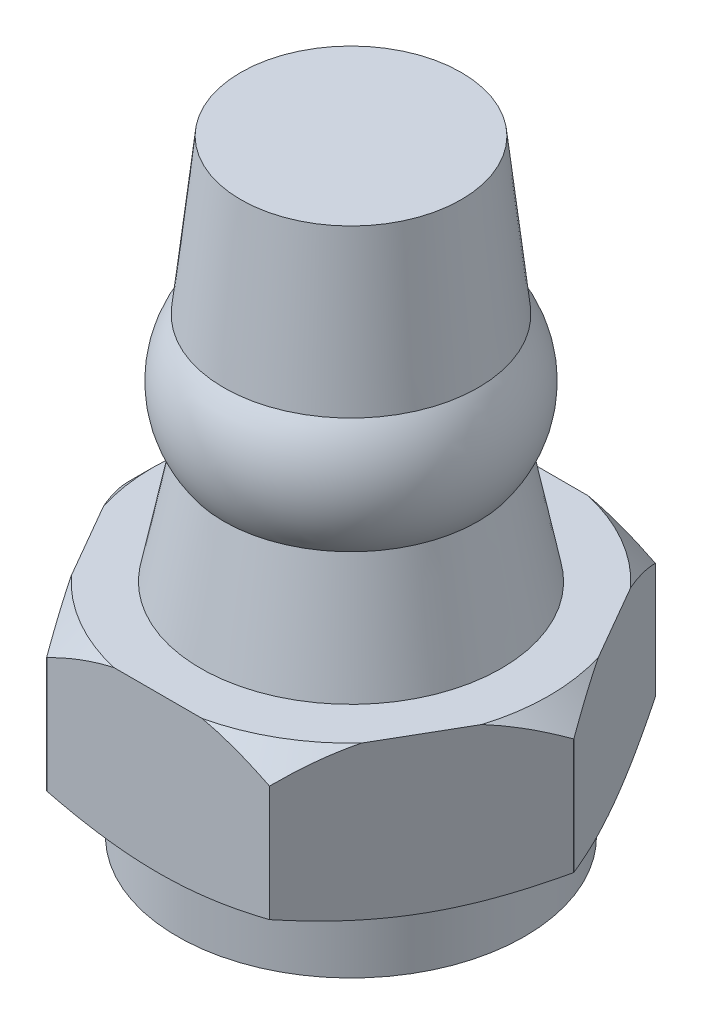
ISO-10303-21;
HEADER;
FILE_DESCRIPTION(('STEP AP214'),'2;1');
FILE_NAME('part.step','',(''),(''),'','','');
FILE_SCHEMA(('AUTOMOTIVE_DESIGN { 1 0 10303 214 1 1 1 1 }'));
ENDSEC;
DATA;
#1=APPLICATION_CONTEXT('core data for automotive mechanical design processes');
#2=APPLICATION_PROTOCOL_DEFINITION('international standard','automotive_design',2000,#1);
#3=PRODUCT_CONTEXT('',#1,'mechanical');
#4=PRODUCT('Part','Part','',(#3));
#5=PRODUCT_RELATED_PRODUCT_CATEGORY('part','',(#4));
#6=PRODUCT_DEFINITION_FORMATION('','',#4);
#7=PRODUCT_DEFINITION_CONTEXT('part definition',#1,'design');
#8=PRODUCT_DEFINITION('design','',#6,#7);
#9=PRODUCT_DEFINITION_SHAPE('','',#8);
#10=(LENGTH_UNIT() NAMED_UNIT(*) SI_UNIT(.MILLI.,.METRE.));
#11=(NAMED_UNIT(*) PLANE_ANGLE_UNIT() SI_UNIT($,.RADIAN.));
#12=(NAMED_UNIT(*) SI_UNIT($,.STERADIAN.) SOLID_ANGLE_UNIT());
#13=UNCERTAINTY_MEASURE_WITH_UNIT(LENGTH_MEASURE(1.E-05),#10,'distance_accuracy_value','');
#14=(GEOMETRIC_REPRESENTATION_CONTEXT(3) GLOBAL_UNCERTAINTY_ASSIGNED_CONTEXT((#13)) GLOBAL_UNIT_ASSIGNED_CONTEXT((#10,
#11,#12)) REPRESENTATION_CONTEXT('',''));
#15=CARTESIAN_POINT('',(0.,0.,0.));
#16=DIRECTION('',(0.,0.,1.));
#17=DIRECTION('',(1.,0.,0.));
#18=AXIS2_PLACEMENT_3D('',#15,#16,#17);
#19=CARTESIAN_POINT('',(1.80411241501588E-12,1.00000000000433,-2.77555756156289E-13));
#20=DIRECTION('',(0.,0.999999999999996,0.));
#21=DIRECTION('',(-0.999999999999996,0.,0.));
#22=AXIS2_PLACEMENT_3D('',#19,#20,#21);
#23=CONICAL_SURFACE('',#22,3.15000000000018,1.10266444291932);
#24=CARTESIAN_POINT('',(1.80411241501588E-12,1.00000000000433,-2.77555756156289E-13));
#25=DIRECTION('',(0.,0.999999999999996,0.));
#26=DIRECTION('',(-0.999999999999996,0.,0.));
#27=AXIS2_PLACEMENT_3D('',#24,#25,#26);
#28=CIRCLE('',#27,3.15000000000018);
#29=CARTESIAN_POINT('',(-3.14999999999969,1.00000000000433,-5.03517583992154E-13));
#30=VERTEX_POINT('',#29);
#31=EDGE_CURVE('E375',#30,#30,#28,.T.);
#32=ORIENTED_EDGE('',*,*,#31,.T.);
#33=EDGE_LOOP('',(#32));
#34=FACE_BOUND('',#33,.T.);
#35=CARTESIAN_POINT('',(-4.04019999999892,1.45010141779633,0.0021683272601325));
#36=CARTESIAN_POINT('',(-3.98391340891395,1.42167051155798,0.0996595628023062));
#37=CARTESIAN_POINT('',(-3.92740569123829,1.39490818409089,0.197533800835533));
#38=CARTESIAN_POINT('',(-3.81393627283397,1.34527331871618,0.39406859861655));
#39=CARTESIAN_POINT('',(-3.75697435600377,1.32240276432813,0.492729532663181));
#40=CARTESIAN_POINT('',(-3.64255321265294,1.28110205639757,0.690912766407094));
#41=CARTESIAN_POINT('',(-3.58509335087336,1.2626788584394,0.790436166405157));
#42=CARTESIAN_POINT('',(-3.46983238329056,1.2308743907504,0.99007401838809));
#43=CARTESIAN_POINT('',(-3.41203133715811,1.21749226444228,1.09018836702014));
#44=CARTESIAN_POINT('',(-3.29750405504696,1.19647104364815,1.28855543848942));
#45=CARTESIAN_POINT('',(-3.24078360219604,1.18870717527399,1.38679814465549));
#46=CARTESIAN_POINT('',(-3.12721671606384,1.17871089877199,1.58350176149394));
#47=CARTESIAN_POINT('',(-3.07037027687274,1.17647875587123,1.68196268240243));
#48=CARTESIAN_POINT('',(-2.95675424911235,1.17763132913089,1.87875141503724));
#49=CARTESIAN_POINT('',(-2.89998464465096,1.18100988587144,1.97707925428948));
#50=CARTESIAN_POINT('',(-2.78659954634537,1.1932437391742,2.17346800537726));
#51=CARTESIAN_POINT('',(-2.72998403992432,1.20209857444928,2.27152893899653));
#52=CARTESIAN_POINT('',(-2.61884932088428,1.22459674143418,2.46401991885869));
#53=CARTESIAN_POINT('',(-2.56432166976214,1.23807546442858,2.5584645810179));
#54=CARTESIAN_POINT('',(-2.45558077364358,1.26945892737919,2.74680933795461));
#55=CARTESIAN_POINT('',(-2.40136757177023,1.28736426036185,2.84070935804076));
#56=CARTESIAN_POINT('',(-2.29267950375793,1.32736190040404,3.02896261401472));
#57=CARTESIAN_POINT('',(-2.2382089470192,1.34950055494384,3.12330838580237));
#58=CARTESIAN_POINT('',(-2.12968608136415,1.39731825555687,3.31127550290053));
#59=CARTESIAN_POINT('',(-2.07563356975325,1.42299545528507,3.40489719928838));
#60=CARTESIAN_POINT('',(-2.02178268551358,1.4502000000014,3.49816966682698));
#61=B_SPLINE_CURVE_WITH_KNOTS('',3,(#35,#36,#37,#38,#39,#40,#41,#42,#43,#44,#45,#46,#47,#48,#49,
#50,#51,#52,#53,#54,#55,#56,#57,#58,#59,#60),.UNSPECIFIED.,.F.,.F.,(4,2,2,2,2,2,2,2,2,2,2,2,4),
(0.,0.348341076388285,0.6968591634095,1.04591884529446,1.39491918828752,1.73590863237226,
2.07691442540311,2.41754611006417,2.75814910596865,3.08770602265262,3.41730711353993,
3.75074800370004,4.08401556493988),.UNSPECIFIED.);
#62=CARTESIAN_POINT('',(-4.0399992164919,1.45000000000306,0.00251609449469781));
#63=VERTEX_POINT('',#62);
#64=CARTESIAN_POINT('',(-2.02217860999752,1.45000000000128,3.49748390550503));
#65=VERTEX_POINT('',#64);
#66=EDGE_CURVE('E264',#63,#65,#61,.T.);
#67=ORIENTED_EDGE('',*,*,#66,.F.);
#68=CARTESIAN_POINT('',(1.80411241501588E-12,1.45000000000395,-2.77555756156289E-13));
#69=DIRECTION('',(0.,0.999999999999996,0.));
#70=DIRECTION('',(-0.999999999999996,0.,0.));
#71=AXIS2_PLACEMENT_3D('',#68,#69,#70);
#72=CIRCLE('',#71,4.04);
#73=CARTESIAN_POINT('',(-4.03999921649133,1.45000000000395,-0.00251609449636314));
#74=VERTEX_POINT('',#73);
#75=EDGE_CURVE('E363',#74,#63,#72,.T.);
#76=ORIENTED_EDGE('',*,*,#75,.F.);
#77=CARTESIAN_POINT('',(-2.02178268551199,1.45020000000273,-3.49816966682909));
#78=CARTESIAN_POINT('',(-2.07807339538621,1.421762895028,-3.4006712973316));
#79=CARTESIAN_POINT('',(-2.1345852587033,1.3949943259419,-3.30278987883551));
#80=CARTESIAN_POINT('',(-2.24806305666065,1.3453470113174,-3.10624056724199));
#81=CARTESIAN_POINT('',(-2.30502920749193,1.32247024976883,-3.00757229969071));
#82=CARTESIAN_POINT('',(-2.41945901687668,1.28115725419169,-2.809374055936));
#83=CARTESIAN_POINT('',(-2.47692331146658,1.26272798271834,-2.70984297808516));
#84=CARTESIAN_POINT('',(-2.59219327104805,1.23091174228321,-2.51018955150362));
#85=CARTESIAN_POINT('',(-2.64999887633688,1.21752391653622,-2.41006730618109));
#86=CARTESIAN_POINT('',(-2.76453514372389,1.1964920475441,-2.2116846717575));
#87=CARTESIAN_POINT('',(-2.821260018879,1.18872320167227,-2.11343430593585));
#88=CARTESIAN_POINT('',(-2.93483587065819,1.17871771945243,-1.91671516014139));
#89=CARTESIAN_POINT('',(-2.99168685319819,1.17648134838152,-1.8182463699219));
#90=CARTESIAN_POINT('',(-3.10531202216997,1.1776263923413,-1.62144180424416));
#91=CARTESIAN_POINT('',(-3.1620862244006,1.1810016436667,-1.52310600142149));
#92=CARTESIAN_POINT('',(-3.27548056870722,1.19322990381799,-1.32670123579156));
#93=CARTESIAN_POINT('',(-3.33210072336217,1.2020824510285,-1.22863225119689));
#94=CARTESIAN_POINT('',(-3.44323100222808,1.22457437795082,-1.03614896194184));
#95=CARTESIAN_POINT('',(-3.49774962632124,1.23804791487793,-0.941719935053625));
#96=CARTESIAN_POINT('',(-3.60647262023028,1.26941982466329,-0.753406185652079));
#97=CARTESIAN_POINT('',(-3.6606769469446,1.28731879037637,-0.659521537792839));
#98=CARTESIAN_POINT('',(-3.76934722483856,1.3273026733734,-0.471299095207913));
#99=CARTESIAN_POINT('',(-3.82380886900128,1.349433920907,-0.376968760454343));
#100=CARTESIAN_POINT('',(-3.9323140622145,1.39723611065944,-0.189032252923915));
#101=CARTESIAN_POINT('',(-3.98635781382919,1.422905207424,-0.09542572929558));
#102=CARTESIAN_POINT('',(-4.04019999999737,1.45010141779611,-0.00216832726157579));
#103=B_SPLINE_CURVE_WITH_KNOTS('',3,(#77,#78,#79,#80,#81,#82,#83,#84,#85,#86,#87,#88,#89,#90,
#91,#92,#93,#94,#95,#96,#97,#98,#99,#100,#101,#102),.UNSPECIFIED.,.F.,.F.,(4,2,2,2,2,2,2,2,2,2,
2,2,4),(0.,0.348369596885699,0.696916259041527,1.04600508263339,1.3950345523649,
1.73605146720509,2.07708473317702,2.41774366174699,2.75837388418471,3.08787518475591,
3.4174206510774,3.75080472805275,4.08401555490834),.UNSPECIFIED.);
#104=CARTESIAN_POINT('',(-2.0221786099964,1.45000000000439,-3.49748390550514));
#105=VERTEX_POINT('',#104);
#106=EDGE_CURVE('E328',#105,#74,#103,.T.);
#107=ORIENTED_EDGE('',*,*,#106,.F.);
#108=CARTESIAN_POINT('',(-2.01782060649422,1.45000000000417,-3.50000000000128));
#109=VERTEX_POINT('',#108);
#110=EDGE_CURVE('E369',#109,#105,#72,.T.);
#111=ORIENTED_EDGE('',*,*,#110,.F.);
#112=CARTESIAN_POINT('',(-5.33602711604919,2.63389035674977,-3.50000000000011));
#113=CARTESIAN_POINT('',(-5.17944142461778,2.56770797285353,-3.50000000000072));
#114=CARTESIAN_POINT('',(-5.02255013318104,2.50223506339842,-3.50000000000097));
#115=CARTESIAN_POINT('',(-4.70799180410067,2.37311477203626,-3.50000000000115));
#116=CARTESIAN_POINT('',(-4.55032465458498,2.30946766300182,-3.50000000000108));
#117=CARTESIAN_POINT('',(-4.23343917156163,2.18416554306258,-3.50000000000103));
#118=CARTESIAN_POINT('',(-4.07421711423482,2.12251991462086,-3.50000000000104));
#119=CARTESIAN_POINT('',(-3.75469979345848,2.00208528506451,-3.50000000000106));
#120=CARTESIAN_POINT('',(-3.59440457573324,1.94329616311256,-3.50000000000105));
#121=CARTESIAN_POINT('',(-3.2747772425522,1.83012280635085,-3.50000000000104));
#122=CARTESIAN_POINT('',(-3.1154629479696,1.77568851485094,-3.50000000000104));
#123=CARTESIAN_POINT('',(-2.79536141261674,1.67126874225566,-3.50000000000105));
#124=CARTESIAN_POINT('',(-2.6345740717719,1.62128356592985,-3.50000000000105));
#125=CARTESIAN_POINT('',(-2.31154314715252,1.52703486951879,-3.50000000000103));
#126=CARTESIAN_POINT('',(-2.14930178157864,1.48276383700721,-3.50000000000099));
#127=CARTESIAN_POINT('',(-1.82306286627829,1.40135093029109,-3.50000000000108));
#128=CARTESIAN_POINT('',(-1.65906565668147,1.36420770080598,-3.50000000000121));
#129=CARTESIAN_POINT('',(-1.28779640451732,1.29051995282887,-3.50000000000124));
#130=CARTESIAN_POINT('',(-1.08000585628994,1.25647142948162,-3.50000000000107));
#131=CARTESIAN_POINT('',(-0.76680347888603,1.2182127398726,-3.50000000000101));
#132=CARTESIAN_POINT('',(-0.662155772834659,1.20759575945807,-3.50000000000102));
#133=CARTESIAN_POINT('',(-0.452501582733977,1.19092811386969,-3.50000000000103));
#134=CARTESIAN_POINT('',(-0.347495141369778,1.18487692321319,-3.50000000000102));
#135=CARTESIAN_POINT('',(-0.136883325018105,1.17751906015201,-3.50000000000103));
#136=CARTESIAN_POINT('',(-0.0312772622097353,1.17623199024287,-3.50000000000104));
#137=CARTESIAN_POINT('',(0.17987405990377,1.17849797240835,-3.50000000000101));
#138=CARTESIAN_POINT('',(0.285419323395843,1.18205063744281,-3.50000000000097));
#139=CARTESIAN_POINT('',(0.496230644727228,1.19387935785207,-3.50000000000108));
#140=CARTESIAN_POINT('',(0.601496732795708,1.2021548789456,-3.50000000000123));
#141=CARTESIAN_POINT('',(0.811569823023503,1.2231716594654,-3.50000000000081));
#142=CARTESIAN_POINT('',(0.916376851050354,1.23591266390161,-3.50000000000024));
#143=CARTESIAN_POINT('',(1.17630533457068,1.27271491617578,-3.49999999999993));
#144=CARTESIAN_POINT('',(1.33107581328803,1.2992674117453,-3.50000000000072));
#145=CARTESIAN_POINT('',(1.6391087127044,1.36009766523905,-3.50000000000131));
#146=CARTESIAN_POINT('',(1.79237065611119,1.39437779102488,-3.50000000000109));
#147=CARTESIAN_POINT('',(2.09752488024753,1.46931946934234,-3.50000000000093));
#148=CARTESIAN_POINT('',(2.24941508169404,1.50998940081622,-3.50000000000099));
#149=CARTESIAN_POINT('',(2.55170679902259,1.59644055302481,-3.50000000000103));
#150=CARTESIAN_POINT('',(2.70210843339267,1.64222136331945,-3.50000000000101));
#151=CARTESIAN_POINT('',(3.00276764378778,1.73824758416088,-3.500000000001));
#152=CARTESIAN_POINT('',(3.15301489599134,1.78852510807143,-3.500000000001));
#153=CARTESIAN_POINT('',(3.45236118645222,1.89240167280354,-3.500000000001));
#154=CARTESIAN_POINT('',(3.60146015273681,1.94600091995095,-3.500000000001));
#155=CARTESIAN_POINT('',(3.89856588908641,2.05582220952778,-3.500000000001));
#156=CARTESIAN_POINT('',(4.0465733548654,2.11204237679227,-3.500000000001));
#157=CARTESIAN_POINT('',(4.34175417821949,2.22663546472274,-3.50000000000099));
#158=CARTESIAN_POINT('',(4.48892751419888,2.28500844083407,-3.50000000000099));
#159=CARTESIAN_POINT('',(4.93270836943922,2.46407285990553,-3.50000000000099));
#160=CARTESIAN_POINT('',(5.228230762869,2.58745150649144,-3.50000000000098));
#161=CARTESIAN_POINT('',(5.81726197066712,2.83902449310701,-3.50000000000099));
#162=CARTESIAN_POINT('',(6.11077042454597,2.96721966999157,-3.500000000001));
#163=CARTESIAN_POINT('',(6.6911053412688,3.22469845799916,-3.50000000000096));
#164=CARTESIAN_POINT('',(6.97795818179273,3.35392273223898,-3.50000000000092));
#165=CARTESIAN_POINT('',(7.4073788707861,3.54952865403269,-3.500000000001));
#166=CARTESIAN_POINT('',(7.55035562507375,3.61501605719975,-3.50000000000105));
#167=CARTESIAN_POINT('',(7.83606902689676,3.74650982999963,-3.50000000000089));
#168=CARTESIAN_POINT('',(7.97880567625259,3.81251619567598,-3.50000000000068));
#169=CARTESIAN_POINT('',(8.12143950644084,3.87874417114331,-3.50000000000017));
#170=B_SPLINE_CURVE_WITH_KNOTS('',3,(#112,#113,#114,#115,#116,#117,#118,#119,#120,#121,#122,
#123,#124,#125,#126,#127,#128,#129,#130,#131,#132,#133,#134,#135,#136,#137,#138,#139,#140,#141,
#142,#143,#144,#145,#146,#147,#148,#149,#150,#151,#152,#153,#154,#155,#156,#157,#158,#159,#160,
#161,#162,#163,#164,#165,#166,#167,#168,#169),.UNSPECIFIED.,.F.,.F.,(4,2,2,2,2,2,2,2,2,2,2,2,2,
2,2,2,2,2,2,2,2,2,2,2,2,2,2,2,4),(0.,0.509998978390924,1.02007378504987,1.53226926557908,
2.04444306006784,2.54946294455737,3.0545173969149,3.55890093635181,4.06318847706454,
4.69420037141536,5.00967132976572,5.32510597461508,5.64183707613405,5.95854284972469,
6.27521280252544,6.5918646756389,7.06270842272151,7.53369663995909,8.00530769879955,
8.47688091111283,8.95214180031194,9.4274322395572,9.90238769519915,10.3773553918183,
11.3380118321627,12.2988359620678,13.2426689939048,13.714450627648,14.1862286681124),.UNSPECIFIED.);
#171=CARTESIAN_POINT('',(2.01782060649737,1.45000000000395,-3.49999999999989));
#172=VERTEX_POINT('',#171);
#173=EDGE_CURVE('E314',#172,#109,#170,.F.);
#174=ORIENTED_EDGE('',*,*,#173,.F.);
#175=CARTESIAN_POINT('',(2.02217860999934,1.4500000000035,-3.49748390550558));
#176=VERTEX_POINT('',#175);
#177=EDGE_CURVE('E385',#176,#172,#72,.T.);
#178=ORIENTED_EDGE('',*,*,#177,.F.);
#179=CARTESIAN_POINT('',(4.04020000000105,1.45010141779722,-0.00216832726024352));
#180=CARTESIAN_POINT('',(3.98391340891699,1.42167051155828,-0.0996595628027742));
#181=CARTESIAN_POINT('',(3.92740569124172,1.39490818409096,-0.19753380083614));
#182=CARTESIAN_POINT('',(3.81393627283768,1.34527331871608,-0.39406859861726));
#183=CARTESIAN_POINT('',(3.75697435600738,1.3224027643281,-0.492729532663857));
#184=CARTESIAN_POINT('',(3.64255321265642,1.28110205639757,-0.690912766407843));
#185=CARTESIAN_POINT('',(3.58509335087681,1.26267885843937,-0.790436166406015));
#186=CARTESIAN_POINT('',(3.46983238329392,1.23087439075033,-0.990074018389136));
#187=CARTESIAN_POINT('',(3.41203133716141,1.21749226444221,-1.09018836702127));
#188=CARTESIAN_POINT('',(3.29750405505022,1.19647104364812,-1.28855543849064));
#189=CARTESIAN_POINT('',(3.24078360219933,1.188707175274,-1.38679814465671));
#190=CARTESIAN_POINT('',(3.12721671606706,1.17871089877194,-1.58350176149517));
#191=CARTESIAN_POINT('',(3.07037027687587,1.17647875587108,-1.68196268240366));
#192=CARTESIAN_POINT('',(2.95675424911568,1.17763132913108,-1.87875141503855));
#193=CARTESIAN_POINT('',(2.89998464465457,1.18100988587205,-1.97707925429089));
#194=CARTESIAN_POINT('',(2.78659954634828,1.19324373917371,-2.17346800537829));
#195=CARTESIAN_POINT('',(2.72998403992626,1.20209857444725,-2.27152893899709));
#196=CARTESIAN_POINT('',(2.61884932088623,1.22459674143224,-2.46401991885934));
#197=CARTESIAN_POINT('',(2.564321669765,1.23807546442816,-2.55846458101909));
#198=CARTESIAN_POINT('',(2.45558077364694,1.26945892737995,-2.7468093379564));
#199=CARTESIAN_POINT('',(2.40136757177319,1.28736426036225,-2.8407093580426));
#200=CARTESIAN_POINT('',(2.29267950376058,1.32736190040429,-3.02896261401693));
#201=CARTESIAN_POINT('',(2.23820894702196,1.3495005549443,-3.12330838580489));
#202=CARTESIAN_POINT('',(2.12968608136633,1.39731825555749,-3.31127550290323));
#203=CARTESIAN_POINT('',(2.07563356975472,1.42299545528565,-3.40489719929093));
#204=CARTESIAN_POINT('',(2.02178268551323,1.4502000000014,-3.49816966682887));
#205=B_SPLINE_CURVE_WITH_KNOTS('',3,(#179,#180,#181,#182,#183,#184,#185,#186,#187,#188,#189,
#190,#191,#192,#193,#194,#195,#196,#197,#198,#199,#200,#201,#202,#203,#204),.UNSPECIFIED.,.F.,
.F.,(4,2,2,2,2,2,2,2,2,2,2,2,4),(0.,0.348341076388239,0.696859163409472,1.04591884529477,
1.39491918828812,1.73590863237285,2.0769144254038,2.4175461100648,2.7581491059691,
3.08770602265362,3.41730711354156,3.7507480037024,4.08401556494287),.UNSPECIFIED.);
#206=CARTESIAN_POINT('',(4.03999921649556,1.45000000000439,-0.00251609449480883));
#207=VERTEX_POINT('',#206);
#208=EDGE_CURVE('E436',#207,#176,#205,.T.);
#209=ORIENTED_EDGE('',*,*,#208,.F.);
#210=CARTESIAN_POINT('',(4.03999921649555,1.45000000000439,0.00251609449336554));
#211=VERTEX_POINT('',#210);
#212=EDGE_CURVE('E376',#211,#207,#72,.T.);
#213=ORIENTED_EDGE('',*,*,#212,.F.);
#214=CARTESIAN_POINT('',(2.02178268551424,1.45020000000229,3.4981696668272));
#215=CARTESIAN_POINT('',(2.07807339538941,1.42176289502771,3.40067129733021));
#216=CARTESIAN_POINT('',(2.13458525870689,1.39499432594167,3.30278987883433));
#217=CARTESIAN_POINT('',(2.24806305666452,1.34534701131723,3.10624056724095));
#218=CARTESIAN_POINT('',(2.30502920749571,1.32247024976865,3.00757229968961));
#219=CARTESIAN_POINT('',(2.4194590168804,1.28115725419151,2.80937405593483));
#220=CARTESIAN_POINT('',(2.47692331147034,1.26272798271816,2.70984297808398));
#221=CARTESIAN_POINT('',(2.59219327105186,1.23091174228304,2.5101895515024));
#222=CARTESIAN_POINT('',(2.6499988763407,1.21752391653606,2.41006730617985));
#223=CARTESIAN_POINT('',(2.76453514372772,1.19649204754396,2.21168467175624));
#224=CARTESIAN_POINT('',(2.82126001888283,1.18872320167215,2.11343430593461));
#225=CARTESIAN_POINT('',(2.93483587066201,1.17871771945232,1.91671516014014));
#226=CARTESIAN_POINT('',(2.99168685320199,1.1764813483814,1.81824636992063));
#227=CARTESIAN_POINT('',(3.10531202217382,1.17762639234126,1.62144180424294));
#228=CARTESIAN_POINT('',(3.16208622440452,1.18100164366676,1.52310600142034));
#229=CARTESIAN_POINT('',(3.27548056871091,1.19322990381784,1.32670123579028));
#230=CARTESIAN_POINT('',(3.33210072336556,1.20208245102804,1.22863225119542));
#231=CARTESIAN_POINT('',(3.44323100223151,1.2245743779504,1.03614896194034));
#232=CARTESIAN_POINT('',(3.49774962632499,1.23804791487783,0.941719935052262));
#233=CARTESIAN_POINT('',(3.60647262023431,1.26941982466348,0.753406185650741));
#234=CARTESIAN_POINT('',(3.6606769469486,1.28731879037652,0.659521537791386));
#235=CARTESIAN_POINT('',(3.76934722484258,1.32730267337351,0.471299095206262));
#236=CARTESIAN_POINT('',(3.82380886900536,1.3494339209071,0.376968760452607));
#237=CARTESIAN_POINT('',(3.93231406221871,1.39723611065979,0.189032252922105));
#238=CARTESIAN_POINT('',(3.98635781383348,1.4229052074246,0.0954257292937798));
#239=CARTESIAN_POINT('',(4.04020000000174,1.45010141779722,0.00216832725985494));
#240=B_SPLINE_CURVE_WITH_KNOTS('',3,(#214,#215,#216,#217,#218,#219,#220,#221,#222,#223,#224,
#225,#226,#227,#228,#229,#230,#231,#232,#233,#234,#235,#236,#237,#238,#239),.UNSPECIFIED.,.F.,
.F.,(4,2,2,2,2,2,2,2,2,2,2,2,4),(0.,0.348369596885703,0.696916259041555,1.04600508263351,
1.39503455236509,1.73605146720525,2.07708473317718,2.41774366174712,2.75837388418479,
3.08787518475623,3.41742065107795,3.75080472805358,4.08401555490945),.UNSPECIFIED.);
#241=CARTESIAN_POINT('',(2.02217860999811,1.45000000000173,3.49748390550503));
#242=VERTEX_POINT('',#241);
#243=EDGE_CURVE('E455',#242,#211,#240,.T.);
#244=ORIENTED_EDGE('',*,*,#243,.F.);
#245=CARTESIAN_POINT('',(2.01782060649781,1.45000000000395,3.49999999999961));
#246=VERTEX_POINT('',#245);
#247=EDGE_CURVE('E365',#246,#242,#72,.T.);
#248=ORIENTED_EDGE('',*,*,#247,.F.);
#249=CARTESIAN_POINT('',(-6.50531349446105,3.1423490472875,3.49999999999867));
#250=CARTESIAN_POINT('',(-6.33706733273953,3.06744922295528,3.49999999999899));
#251=CARTESIAN_POINT('',(-6.1685865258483,2.99307026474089,3.49999999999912));
#252=CARTESIAN_POINT('',(-5.83103215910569,2.84563937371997,3.49999999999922));
#253=CARTESIAN_POINT('',(-5.6619585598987,2.77258753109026,3.49999999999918));
#254=CARTESIAN_POINT('',(-5.32278761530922,2.62796555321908,3.49999999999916));
#255=CARTESIAN_POINT('',(-5.15268891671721,2.55639858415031,3.49999999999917));
#256=CARTESIAN_POINT('',(-4.81165164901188,2.41530000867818,3.49999999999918));
#257=CARTESIAN_POINT('',(-4.64071309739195,2.34576836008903,3.49999999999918));
#258=CARTESIAN_POINT('',(-4.29432621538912,2.20787911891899,3.49999999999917));
#259=CARTESIAN_POINT('',(-4.11885686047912,2.13957414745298,3.49999999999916));
#260=CARTESIAN_POINT('',(-3.76662591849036,2.00638609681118,3.49999999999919));
#261=CARTESIAN_POINT('',(-3.58986437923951,1.94150289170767,3.49999999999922));
#262=CARTESIAN_POINT('',(-3.23483592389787,1.81618962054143,3.49999999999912));
#263=CARTESIAN_POINT('',(-3.05656962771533,1.75575781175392,3.49999999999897));
#264=CARTESIAN_POINT('',(-2.69818715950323,1.64068599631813,3.49999999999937));
#265=CARTESIAN_POINT('',(-2.51807119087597,1.58604536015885,3.49999999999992));
#266=CARTESIAN_POINT('',(-2.09755749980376,1.4679694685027,3.50000000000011));
#267=CARTESIAN_POINT('',(-1.85635495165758,1.40733485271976,3.49999999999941));
#268=CARTESIAN_POINT('',(-1.36998504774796,1.30444424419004,3.49999999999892));
#269=CARTESIAN_POINT('',(-1.1248195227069,1.26218000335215,3.49999999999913));
#270=CARTESIAN_POINT('',(-0.755932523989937,1.21677316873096,3.49999999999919));
#271=CARTESIAN_POINT('',(-0.633298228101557,1.20464958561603,3.49999999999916));
#272=CARTESIAN_POINT('',(-0.387561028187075,1.18672294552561,3.49999999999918));
#273=CARTESIAN_POINT('',(-0.264458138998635,1.180919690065,3.49999999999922));
#274=CARTESIAN_POINT('',(-0.0181752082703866,1.17589668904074,3.49999999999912));
#275=CARTESIAN_POINT('',(0.105004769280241,1.17667383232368,3.49999999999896));
#276=CARTESIAN_POINT('',(0.351149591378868,1.18476560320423,3.49999999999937));
#277=CARTESIAN_POINT('',(0.474114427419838,1.19208048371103,3.49999999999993));
#278=CARTESIAN_POINT('',(0.750467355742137,1.2155700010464,3.50000000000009));
#279=CARTESIAN_POINT('',(0.903705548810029,1.23351404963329,3.49999999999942));
#280=CARTESIAN_POINT('',(1.20890877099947,1.27809511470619,3.49999999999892));
#281=CARTESIAN_POINT('',(1.36087359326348,1.30473351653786,3.4999999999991));
#282=CARTESIAN_POINT('',(1.66372454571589,1.36546123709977,3.49999999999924));
#283=CARTESIAN_POINT('',(1.8146065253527,1.39957097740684,3.49999999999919));
#284=CARTESIAN_POINT('',(2.11486683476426,1.47388422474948,3.49999999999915));
#285=CARTESIAN_POINT('',(2.26424495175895,1.51408858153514,3.49999999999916));
#286=CARTESIAN_POINT('',(2.56641873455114,1.60080709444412,3.49999999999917));
#287=CARTESIAN_POINT('',(2.71916727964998,1.64748409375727,3.49999999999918));
#288=CARTESIAN_POINT('',(3.02332541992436,1.74502429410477,3.49999999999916));
#289=CARTESIAN_POINT('',(3.174734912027,1.79588781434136,3.49999999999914));
#290=CARTESIAN_POINT('',(3.47526948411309,1.90055301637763,3.4999999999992));
#291=CARTESIAN_POINT('',(3.6244031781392,1.95433011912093,3.49999999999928));
#292=CARTESIAN_POINT('',(3.92163843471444,2.06452619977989,3.49999999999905));
#293=CARTESIAN_POINT('',(4.06974031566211,2.12094431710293,3.49999999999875));
#294=CARTESIAN_POINT('',(4.21743289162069,2.17838236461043,3.499999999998));
#295=B_SPLINE_CURVE_WITH_KNOTS('',3,(#249,#250,#251,#252,#253,#254,#255,#256,#257,#258,#259,
#260,#261,#262,#263,#264,#265,#266,#267,#268,#269,#270,#271,#272,#273,#274,#275,#276,#277,#278,
#279,#280,#281,#282,#283,#284,#285,#286,#287,#288,#289,#290,#291,#292,#293,#294),.UNSPECIFIED.,
.F.,.F.,(4,2,2,2,2,2,2,2,2,2,2,2,2,2,2,2,2,2,2,2,2,2,4),(0.,0.552497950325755,1.10503330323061,
1.65864580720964,2.21224682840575,2.77710456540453,3.34194150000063,3.90655611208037,
4.47110928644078,5.2167440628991,5.96204371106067,6.33159961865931,6.70114392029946,
7.07051351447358,7.43989739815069,7.90245726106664,8.36509086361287,8.82900513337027,
9.29298414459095,9.7720726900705,10.2511977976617,10.7267707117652,11.2021897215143),.UNSPECIFIED.);
#296=CARTESIAN_POINT('',(-2.01782060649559,1.45000000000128,3.49999999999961));
#297=VERTEX_POINT('',#296);
#298=EDGE_CURVE('E229',#297,#246,#295,.T.);
#299=ORIENTED_EDGE('',*,*,#298,.F.);
#300=EDGE_CURVE('E358',#65,#297,#72,.T.);
#301=ORIENTED_EDGE('',*,*,#300,.F.);
#302=EDGE_LOOP('',(#67,#76,#107,#111,#174,#178,#209,#213,#244,#248,#299,#301));
#303=FACE_BOUND('',#302,.T.);
#304=ADVANCED_FACE('F38',(#34,#303),#23,.T.);
#305=CARTESIAN_POINT('',(4.44089209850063E-13,11.0000000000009,-4.9960036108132E-13));
#306=DIRECTION('',(0.,0.999999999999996,0.));
#307=DIRECTION('',(-0.999999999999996,0.,0.));
#308=AXIS2_PLACEMENT_3D('',#305,#306,#307);
#309=CYLINDRICAL_SURFACE('',#308,4.04);
#310=DIRECTION('',(0.,0.999999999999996,0.));
#311=VECTOR('',#310,1.);
#312=CARTESIAN_POINT('',(-2.02217860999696,11.,3.49748390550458));
#313=LINE('',#312,#311);
#314=CARTESIAN_POINT('',(-2.02217860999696,3.55000000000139,3.49748390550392));
#315=VERTEX_POINT('',#314);
#316=EDGE_CURVE('E342',#65,#315,#313,.T.);
#317=ORIENTED_EDGE('',*,*,#316,.F.);
#318=ORIENTED_EDGE('',*,*,#300,.T.);
#319=DIRECTION('',(0.,0.999999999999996,0.));
#320=VECTOR('',#319,1.);
#321=CARTESIAN_POINT('',(-2.01782060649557,11.,3.49999999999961));
#322=LINE('',#321,#320);
#323=CARTESIAN_POINT('',(-2.01782060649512,3.55000000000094,3.49999999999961));
#324=VERTEX_POINT('',#323);
#325=EDGE_CURVE('E269',#324,#297,#322,.F.);
#326=ORIENTED_EDGE('',*,*,#325,.F.);
#327=CARTESIAN_POINT('',(1.80411241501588E-12,3.55000000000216,-2.77555756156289E-13));
#328=DIRECTION('',(0.,0.999999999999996,0.));
#329=DIRECTION('',(-0.999999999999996,0.,0.));
#330=AXIS2_PLACEMENT_3D('',#327,#328,#329);
#331=CIRCLE('',#330,4.04);
#332=EDGE_CURVE('E191',#315,#324,#331,.T.);
#333=ORIENTED_EDGE('',*,*,#332,.F.);
#334=EDGE_LOOP('',(#317,#318,#326,#333));
#335=FACE_BOUND('',#334,.T.);
#336=ADVANCED_FACE('F278',(#335),#309,.T.);
#337=DIRECTION('',(0.,0.999999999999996,0.));
#338=VECTOR('',#337,1.);
#339=CARTESIAN_POINT('',(-4.03999921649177,11.0000000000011,0.00251609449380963));
#340=LINE('',#339,#338);
#341=CARTESIAN_POINT('',(-4.03999921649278,3.55000000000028,0.00251609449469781));
#342=VERTEX_POINT('',#341);
#343=EDGE_CURVE('E340',#342,#63,#340,.F.);
#344=ORIENTED_EDGE('',*,*,#343,.F.);
#345=CARTESIAN_POINT('',(-4.03999921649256,3.55000000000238,-0.00251609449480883));
#346=VERTEX_POINT('',#345);
#347=EDGE_CURVE('E198',#346,#342,#331,.T.);
#348=ORIENTED_EDGE('',*,*,#347,.F.);
#349=DIRECTION('',(0.,0.999999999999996,0.));
#350=VECTOR('',#349,1.);
#351=CARTESIAN_POINT('',(-4.03999921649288,11.0000000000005,-0.00251609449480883));
#352=LINE('',#351,#350);
#353=EDGE_CURVE('E334',#74,#346,#352,.T.);
#354=ORIENTED_EDGE('',*,*,#353,.F.);
#355=ORIENTED_EDGE('',*,*,#75,.T.);
#356=EDGE_LOOP('',(#344,#348,#354,#355));
#357=FACE_BOUND('',#356,.T.);
#358=ADVANCED_FACE('F411',(#357),#309,.T.);
#359=DIRECTION('',(0.,0.999999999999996,0.));
#360=VECTOR('',#359,1.);
#361=CARTESIAN_POINT('',(-2.022178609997,11.0000000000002,-3.49748390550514));
#362=LINE('',#361,#360);
#363=CARTESIAN_POINT('',(-2.02217860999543,3.55000000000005,-3.4974839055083));
#364=VERTEX_POINT('',#363);
#365=EDGE_CURVE('E319',#364,#105,#362,.F.);
#366=ORIENTED_EDGE('',*,*,#365,.F.);
#367=CARTESIAN_POINT('',(-2.01782060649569,3.55000000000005,-3.50000000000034));
#368=VERTEX_POINT('',#367);
#369=EDGE_CURVE('E482',#368,#364,#331,.T.);
#370=ORIENTED_EDGE('',*,*,#369,.F.);
#371=DIRECTION('',(0.,0.999999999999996,0.));
#372=VECTOR('',#371,1.);
#373=CARTESIAN_POINT('',(-2.01782060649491,11.0000000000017,-3.50000000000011));
#374=LINE('',#373,#372);
#375=EDGE_CURVE('E405',#109,#368,#374,.T.);
#376=ORIENTED_EDGE('',*,*,#375,.F.);
#377=ORIENTED_EDGE('',*,*,#110,.T.);
#378=EDGE_LOOP('',(#366,#370,#376,#377));
#379=FACE_BOUND('',#378,.T.);
#380=ADVANCED_FACE('F402',(#379),#309,.T.);
#381=DIRECTION('',(0.,0.999999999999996,0.));
#382=VECTOR('',#381,1.);
#383=CARTESIAN_POINT('',(2.01782060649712,11.000000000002,-3.5000000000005));
#384=LINE('',#383,#382);
#385=CARTESIAN_POINT('',(2.01782060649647,3.55000000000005,-3.5000000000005));
#386=VERTEX_POINT('',#385);
#387=EDGE_CURVE('E437',#386,#172,#384,.F.);
#388=ORIENTED_EDGE('',*,*,#387,.F.);
#389=CARTESIAN_POINT('',(2.02217860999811,3.55000000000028,-3.49748390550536));
#390=VERTEX_POINT('',#389);
#391=EDGE_CURVE('E433',#390,#386,#331,.T.);
#392=ORIENTED_EDGE('',*,*,#391,.F.);
#393=DIRECTION('',(0.,0.999999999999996,0.));
#394=VECTOR('',#393,1.);
#395=CARTESIAN_POINT('',(2.02217860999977,11.0000000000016,-3.49748390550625));
#396=LINE('',#395,#394);
#397=EDGE_CURVE('E438',#176,#390,#396,.T.);
#398=ORIENTED_EDGE('',*,*,#397,.F.);
#399=ORIENTED_EDGE('',*,*,#177,.T.);
#400=EDGE_LOOP('',(#388,#392,#398,#399));
#401=FACE_BOUND('',#400,.T.);
#402=ADVANCED_FACE('F496',(#401),#309,.T.);
#403=DIRECTION('',(0.,0.999999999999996,0.));
#404=VECTOR('',#403,1.);
#405=CARTESIAN_POINT('',(4.03999921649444,11.0000000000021,-0.00251609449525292));
#406=LINE('',#405,#404);
#407=CARTESIAN_POINT('',(4.0399992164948,3.55000000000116,-0.00251609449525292));
#408=VERTEX_POINT('',#407);
#409=EDGE_CURVE('E443',#408,#207,#406,.F.);
#410=ORIENTED_EDGE('',*,*,#409,.F.);
#411=CARTESIAN_POINT('',(4.03999921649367,3.55000000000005,0.00251609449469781));
#412=VERTEX_POINT('',#411);
#413=EDGE_CURVE('E371',#412,#408,#331,.T.);
#414=ORIENTED_EDGE('',*,*,#413,.F.);
#415=DIRECTION('',(0.,0.999999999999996,0.));
#416=VECTOR('',#415,1.);
#417=CARTESIAN_POINT('',(4.03999921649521,11.0000000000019,0.00251609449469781));
#418=LINE('',#417,#416);
#419=EDGE_CURVE('E461',#211,#412,#418,.T.);
#420=ORIENTED_EDGE('',*,*,#419,.F.);
#421=ORIENTED_EDGE('',*,*,#212,.T.);
#422=EDGE_LOOP('',(#410,#414,#420,#421));
#423=FACE_BOUND('',#422,.T.);
#424=ADVANCED_FACE('F489',(#423),#309,.T.);
#425=DIRECTION('',(0.,0.999999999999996,0.));
#426=VECTOR('',#425,1.);
#427=CARTESIAN_POINT('',(2.02217860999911,11.0000000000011,3.49748390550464));
#428=LINE('',#427,#426);
#429=CARTESIAN_POINT('',(2.02217860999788,3.55000000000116,3.49748390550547));
#430=VERTEX_POINT('',#429);
#431=EDGE_CURVE('E462',#430,#242,#428,.F.);
#432=ORIENTED_EDGE('',*,*,#431,.F.);
#433=CARTESIAN_POINT('',(2.01782060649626,3.55000000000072,3.5));
#434=VERTEX_POINT('',#433);
#435=EDGE_CURVE('E184',#434,#430,#331,.T.);
#436=ORIENTED_EDGE('',*,*,#435,.F.);
#437=DIRECTION('',(0.,0.999999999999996,0.));
#438=VECTOR('',#437,1.);
#439=CARTESIAN_POINT('',(2.01782060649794,11.0000000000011,3.49999999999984));
#440=LINE('',#439,#438);
#441=EDGE_CURVE('E237',#246,#434,#440,.T.);
#442=ORIENTED_EDGE('',*,*,#441,.F.);
#443=ORIENTED_EDGE('',*,*,#247,.T.);
#444=EDGE_LOOP('',(#432,#436,#442,#443));
#445=FACE_BOUND('',#444,.T.);
#446=ADVANCED_FACE('F275',(#445),#309,.T.);
#447=CARTESIAN_POINT('',(1.80411241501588E-12,3.55000000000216,-2.77555756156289E-13));
#448=DIRECTION('',(0.,-0.999999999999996,0.));
#449=DIRECTION('',(0.999999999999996,0.,0.));
#450=AXIS2_PLACEMENT_3D('',#447,#448,#449);
#451=CONICAL_SURFACE('',#450,4.04,0.785398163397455);
#452=CARTESIAN_POINT('',(-0.496781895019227,1.4303857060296,6.1395485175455));
#453=CARTESIAN_POINT('',(-0.542632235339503,1.50584018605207,6.06013339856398));
#454=CARTESIAN_POINT('',(-0.588642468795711,1.58090555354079,5.98044133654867));
#455=CARTESIAN_POINT('',(-0.681032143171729,1.7301286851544,5.82041772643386));
#456=CARTESIAN_POINT('',(-0.727411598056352,1.80428641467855,5.7400861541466));
#457=CARTESIAN_POINT('',(-0.8673005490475,2.02539759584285,5.49779138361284));
#458=CARTESIAN_POINT('',(-0.961435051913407,2.17078121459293,5.33474564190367));
#459=CARTESIAN_POINT('',(-1.15404754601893,2.45907169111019,5.00113101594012));
#460=CARTESIAN_POINT('',(-1.2525756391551,2.60184524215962,4.83047535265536));
#461=CARTESIAN_POINT('',(-1.4525830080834,2.87875729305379,4.48405242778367));
#462=CARTESIAN_POINT('',(-1.55406057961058,3.01290064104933,4.30828811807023));
#463=CARTESIAN_POINT('',(-1.72106228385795,3.21910136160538,4.01903268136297));
#464=CARTESIAN_POINT('',(-1.78535156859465,3.29514382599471,3.90768037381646));
#465=CARTESIAN_POINT('',(-1.91568470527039,3.44092594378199,3.68193675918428));
#466=CARTESIAN_POINT('',(-1.98172802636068,3.5106674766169,3.56754637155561));
#467=CARTESIAN_POINT('',(-2.11552941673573,3.64165240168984,3.33579556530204));
#468=CARTESIAN_POINT('',(-2.18327809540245,3.70293376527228,3.21845141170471));
#469=CARTESIAN_POINT('',(-2.32093996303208,3.81488935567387,2.9800140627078));
#470=CARTESIAN_POINT('',(-2.39085207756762,3.86556875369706,2.85892272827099));
#471=CARTESIAN_POINT('',(-2.51249164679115,3.94082344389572,2.6482368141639));
#472=CARTESIAN_POINT('',(-2.56370368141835,3.96871944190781,2.55953496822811));
#473=CARTESIAN_POINT('',(-2.66706166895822,4.01649169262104,2.3805136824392));
#474=CARTESIAN_POINT('',(-2.71920749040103,4.0363690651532,2.29019447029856));
#475=CARTESIAN_POINT('',(-2.82402325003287,4.06710465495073,2.10864824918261));
#476=CARTESIAN_POINT('',(-2.87669136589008,4.07798737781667,2.0174243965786));
#477=CARTESIAN_POINT('',(-2.98230657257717,4.09022766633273,1.83449349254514));
#478=CARTESIAN_POINT('',(-3.0352536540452,4.09158554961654,1.74278645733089));
#479=CARTESIAN_POINT('',(-3.14102472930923,4.08469574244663,1.55958558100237));
#480=CARTESIAN_POINT('',(-3.19384861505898,4.07644152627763,1.46809192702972));
#481=CARTESIAN_POINT('',(-3.29893328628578,4.05078033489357,1.28607993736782));
#482=CARTESIAN_POINT('',(-3.35119402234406,4.0333725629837,1.19556168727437));
#483=CARTESIAN_POINT('',(-3.45501668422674,3.99020797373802,1.01573556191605));
#484=CARTESIAN_POINT('',(-3.50657568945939,3.96442343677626,0.926432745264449));
#485=CARTESIAN_POINT('',(-3.60863750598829,3.90561528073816,0.74965649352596));
#486=CARTESIAN_POINT('',(-3.65914031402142,3.87259163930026,0.66218306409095));
#487=CARTESIAN_POINT('',(-3.76867924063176,3.79344915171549,0.472456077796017));
#488=CARTESIAN_POINT('',(-3.82747947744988,3.74603297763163,0.370611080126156));
#489=CARTESIAN_POINT('',(-3.94354601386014,3.64418901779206,0.169577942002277));
#490=CARTESIAN_POINT('',(-4.00081177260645,3.58975879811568,0.0703907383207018));
#491=CARTESIAN_POINT('',(-4.11402809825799,3.47521280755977,-0.125705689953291));
#492=CARTESIAN_POINT('',(-4.16997598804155,3.41508653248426,-0.222610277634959));
#493=CARTESIAN_POINT('',(-4.28059726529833,3.29037921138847,-0.414211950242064));
#494=CARTESIAN_POINT('',(-4.33527083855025,3.22579882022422,-0.508909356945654));
#495=CARTESIAN_POINT('',(-4.44385939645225,3.09263691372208,-0.696990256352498));
#496=CARTESIAN_POINT('',(-4.49776735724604,3.02403259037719,-0.790361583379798));
#497=CARTESIAN_POINT('',(-4.60462036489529,2.88388539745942,-0.975436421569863));
#498=CARTESIAN_POINT('',(-4.65756534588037,2.81234232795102,-1.06713981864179));
#499=CARTESIAN_POINT('',(-4.81505691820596,2.59429174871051,-1.33992322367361));
#500=CARTESIAN_POINT('',(-4.91837181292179,2.44422276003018,-1.51886987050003));
#501=CARTESIAN_POINT('',(-5.06696913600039,2.22105933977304,-1.77624798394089));
#502=CARTESIAN_POINT('',(-5.11323021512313,2.15052761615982,-1.85637452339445));
#503=CARTESIAN_POINT('',(-5.2053075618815,2.0082927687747,-2.01585716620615));
#504=CARTESIAN_POINT('',(-5.25112378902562,1.93658953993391,-2.09521319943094));
#505=CARTESIAN_POINT('',(-5.3870068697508,1.7214958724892,-2.33056959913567));
#506=CARTESIAN_POINT('',(-5.47649305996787,1.57663166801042,-2.48556422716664));
#507=CARTESIAN_POINT('',(-5.56539593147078,1.43038570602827,-2.63954851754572));
#508=B_SPLINE_CURVE_WITH_KNOTS('',3,(#452,#453,#454,#455,#456,#457,#458,#459,#460,#461,#462,
#463,#464,#465,#466,#467,#468,#469,#470,#471,#472,#473,#474,#475,#476,#477,#478,#479,#480,#481,
#482,#483,#484,#485,#486,#487,#488,#489,#490,#491,#492,#493,#494,#495,#496,#497,#498,#499,#500,
#501,#502,#503,#504,#505,#506,#507),.UNSPECIFIED.,.F.,.F.,(4,2,2,2,2,2,2,2,2,2,2,2,2,2,2,2,2,2,
2,2,2,2,2,2,2,2,2,4),(0.,0.356257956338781,0.712529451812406,1.42605024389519,2.15593784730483,
2.88541177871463,3.33342716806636,3.78130847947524,4.22710925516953,4.67269207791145,
4.99088519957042,5.30903386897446,5.62631286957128,5.94358128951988,6.26106523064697,
6.57857680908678,6.89714995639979,7.21572408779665,7.59583041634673,7.97606900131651,
8.35702297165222,8.73792105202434,9.12123842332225,9.50458191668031,10.27047875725,
10.6194966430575,10.9685460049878,11.6592369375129),.UNSPECIFIED.);
#509=CARTESIAN_POINT('',(-2.63168310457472,4.00000000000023,2.441791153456));
#510=VERTEX_POINT('',#509);
#511=EDGE_CURVE('E53',#315,#510,#508,.T.);
#512=ORIENTED_EDGE('',*,*,#511,.F.);
#513=ORIENTED_EDGE('',*,*,#332,.T.);
#514=CARTESIAN_POINT('',(7.11753383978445,-0.341537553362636,3.5));
#515=CARTESIAN_POINT('',(6.91007266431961,-0.155426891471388,3.49999999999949));
#516=CARTESIAN_POINT('',(6.70187423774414,0.029873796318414,3.49999999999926));
#517=CARTESIAN_POINT('',(6.28340789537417,0.398260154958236,3.49999999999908));
#518=CARTESIAN_POINT('',(6.07313932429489,0.5813450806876,3.49999999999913));
#519=CARTESIAN_POINT('',(5.64776042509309,0.946567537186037,3.49999999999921));
#520=CARTESIAN_POINT('',(5.43262229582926,1.12867283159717,3.49999999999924));
#521=CARTESIAN_POINT('',(5.10738456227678,1.39873625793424,3.49999999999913));
#522=CARTESIAN_POINT('',(4.99856193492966,1.48823229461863,3.49999999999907));
#523=CARTESIAN_POINT('',(4.7799176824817,1.66601768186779,3.49999999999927));
#524=CARTESIAN_POINT('',(4.67009596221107,1.75430691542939,3.49999999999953));
#525=CARTESIAN_POINT('',(4.35639461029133,2.00315954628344,3.49999999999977));
#526=CARTESIAN_POINT('',(4.15114817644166,2.16200885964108,3.49999999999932));
#527=CARTESIAN_POINT('',(3.73553391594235,2.47286172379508,3.49999999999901));
#528=CARTESIAN_POINT('',(3.52516702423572,2.62486651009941,3.49999999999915));
#529=CARTESIAN_POINT('',(3.20462497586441,2.84514258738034,3.49999999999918));
#530=CARTESIAN_POINT('',(3.09705987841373,2.91720863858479,3.49999999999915));
#531=CARTESIAN_POINT('',(2.87990817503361,3.05821928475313,3.49999999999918));
#532=CARTESIAN_POINT('',(2.77032176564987,3.12716418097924,3.49999999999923));
#533=CARTESIAN_POINT('',(2.54888709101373,3.26113616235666,3.49999999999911));
#534=CARTESIAN_POINT('',(2.43704068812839,3.3261663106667,3.49999999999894));
#535=CARTESIAN_POINT('',(2.21067450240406,3.45137830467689,3.4999999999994));
#536=CARTESIAN_POINT('',(2.09615524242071,3.51156108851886,3.50000000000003));
#537=CARTESIAN_POINT('',(1.87191494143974,3.62197794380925,3.49999999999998));
#538=CARTESIAN_POINT('',(1.7623908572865,3.6726091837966,3.4999999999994));
#539=CARTESIAN_POINT('',(1.54049931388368,3.76729498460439,3.49999999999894));
#540=CARTESIAN_POINT('',(1.42813170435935,3.81134919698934,3.49999999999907));
#541=CARTESIAN_POINT('',(1.20089821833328,3.89123158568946,3.49999999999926));
#542=CARTESIAN_POINT('',(1.08604197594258,3.92708683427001,3.49999999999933));
#543=CARTESIAN_POINT('',(0.853754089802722,3.98911190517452,3.49999999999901));
#544=CARTESIAN_POINT('',(0.736323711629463,4.01528637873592,3.49999999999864));
#545=CARTESIAN_POINT('',(0.516529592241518,4.05349988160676,3.4999999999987));
#546=CARTESIAN_POINT('',(0.414426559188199,4.06702999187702,3.49999999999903));
#547=CARTESIAN_POINT('',(0.209434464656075,4.08522480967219,3.49999999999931));
#548=CARTESIAN_POINT('',(0.106545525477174,4.08989086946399,3.49999999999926));
#549=CARTESIAN_POINT('',(-0.0991682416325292,4.09010524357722,3.49999999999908));
#550=CARTESIAN_POINT('',(-0.201993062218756,4.0856601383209,3.49999999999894));
#551=CARTESIAN_POINT('',(-0.406877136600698,4.06790955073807,3.49999999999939));
#552=CARTESIAN_POINT('',(-0.508936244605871,4.05460242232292,3.49999999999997));
#553=CARTESIAN_POINT('',(-0.742541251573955,4.01447106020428,3.50000000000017));
#554=CARTESIAN_POINT('',(-0.873592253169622,3.98476294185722,3.49999999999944));
#555=CARTESIAN_POINT('',(-1.1324058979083,3.91347706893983,3.4999999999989));
#556=CARTESIAN_POINT('',(-1.26016698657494,3.87189381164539,3.49999999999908));
#557=CARTESIAN_POINT('',(-1.51384694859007,3.77848797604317,3.49999999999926));
#558=CARTESIAN_POINT('',(-1.63971626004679,3.72653233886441,3.49999999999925));
#559=CARTESIAN_POINT('',(-1.82582724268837,3.64277549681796,3.49999999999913));
#560=CARTESIAN_POINT('',(-1.88740973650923,3.61388897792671,3.49999999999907));
#561=CARTESIAN_POINT('',(-2.00973235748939,3.55438733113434,3.49999999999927));
#562=CARTESIAN_POINT('',(-2.07047251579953,3.52377226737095,3.49999999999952));
#563=CARTESIAN_POINT('',(-2.25346081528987,3.42861869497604,3.49999999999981));
#564=CARTESIAN_POINT('',(-2.37446800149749,3.36168955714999,3.49999999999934));
#565=CARTESIAN_POINT('',(-2.61363215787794,3.22289636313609,3.499999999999));
#566=CARTESIAN_POINT('',(-2.73178834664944,3.15103097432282,3.49999999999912));
#567=CARTESIAN_POINT('',(-2.96574431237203,3.00334559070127,3.49999999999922));
#568=CARTESIAN_POINT('',(-3.08154183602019,2.9275220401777,3.49999999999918));
#569=CARTESIAN_POINT('',(-3.31103994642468,2.77275740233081,3.49999999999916));
#570=CARTESIAN_POINT('',(-3.4247403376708,2.69381602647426,3.49999999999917));
#571=CARTESIAN_POINT('',(-3.76427840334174,2.45246911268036,3.49999999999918));
#572=CARTESIAN_POINT('',(-3.98741943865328,2.28627316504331,3.49999999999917));
#573=CARTESIAN_POINT('',(-4.42836343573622,1.94724789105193,3.49999999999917));
#574=CARTESIAN_POINT('',(-4.64616905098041,1.77442197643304,3.49999999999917));
#575=CARTESIAN_POINT('',(-5.05561244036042,1.44211751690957,3.49999999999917));
#576=CARTESIAN_POINT('',(-5.24762919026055,1.28310437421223,3.49999999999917));
#577=CARTESIAN_POINT('',(-5.62926632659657,0.962180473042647,3.49999999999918));
#578=CARTESIAN_POINT('',(-5.81888636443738,0.800269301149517,3.49999999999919));
#579=CARTESIAN_POINT('',(-6.19420736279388,0.475975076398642,3.49999999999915));
#580=CARTESIAN_POINT('',(-6.37992855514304,0.31361538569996,3.49999999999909));
#581=CARTESIAN_POINT('',(-6.74980652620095,-0.0127935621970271,3.49999999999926));
#582=CARTESIAN_POINT('',(-6.93396364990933,-0.176842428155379,3.49999999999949));
#583=CARTESIAN_POINT('',(-7.11753383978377,-0.341537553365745,3.50000000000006));
#584=B_SPLINE_CURVE_WITH_KNOTS('',3,(#514,#515,#516,#517,#518,#519,#520,#521,#522,#523,#524,
#525,#526,#527,#528,#529,#530,#531,#532,#533,#534,#535,#536,#537,#538,#539,#540,#541,#542,#543,
#544,#545,#546,#547,#548,#549,#550,#551,#552,#553,#554,#555,#556,#557,#558,#559,#560,#561,#562,
#563,#564,#565,#566,#567,#568,#569,#570,#571,#572,#573,#574,#575,#576,#577,#578,#579,#580,#581,
#582,#583),.UNSPECIFIED.,.F.,.F.,(4,2,2,2,2,2,2,2,2,2,2,2,2,2,2,2,2,2,2,2,2,2,2,2,2,2,2,2,2,2,2,
2,2,2,4),(0.,0.83612861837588,1.6725310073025,2.51807681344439,2.94075982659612,
3.36348353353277,4.14200246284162,4.9203802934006,5.30876395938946,5.69711005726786,
6.0851482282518,6.47311111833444,6.8349208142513,7.19674967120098,7.55736597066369,
7.91780878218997,8.22643893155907,8.53502199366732,8.84338226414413,9.15179982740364,
9.55423126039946,9.95684947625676,10.3650094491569,10.5690510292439,10.7730850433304,
11.187769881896,11.6025671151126,12.0177436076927,12.4329586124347,13.2674330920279,
14.101483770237,14.8493777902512,15.5973793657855,16.3374200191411,17.0772929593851),.UNSPECIFIED.);
#585=CARTESIAN_POINT('',(-0.798811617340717,4.00000000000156,3.49999999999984));
#586=VERTEX_POINT('',#585);
#587=EDGE_CURVE('E255',#586,#324,#584,.T.);
#588=ORIENTED_EDGE('',*,*,#587,.F.);
#589=CARTESIAN_POINT('',(1.80411241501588E-12,4.00000000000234,-2.77555756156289E-13));
#590=DIRECTION('',(0.,0.999999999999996,0.));
#591=DIRECTION('',(-0.999999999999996,0.,0.));
#592=AXIS2_PLACEMENT_3D('',#589,#590,#591);
#593=CIRCLE('',#592,3.59000000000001);
#594=EDGE_CURVE('E194',#510,#586,#593,.T.);
#595=ORIENTED_EDGE('',*,*,#594,.F.);
#596=EDGE_LOOP('',(#512,#513,#588,#595));
#597=FACE_BOUND('',#596,.T.);
#598=ADVANCED_FACE('F270',(#597),#451,.T.);
#599=CARTESIAN_POINT('',(-3.43049472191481,4.00000000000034,1.05820884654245));
#600=VERTEX_POINT('',#599);
#601=EDGE_CURVE('E333',#600,#342,#508,.T.);
#602=ORIENTED_EDGE('',*,*,#601,.F.);
#603=CARTESIAN_POINT('',(-3.43049472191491,4.00000000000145,-1.05820884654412));
#604=VERTEX_POINT('',#603);
#605=EDGE_CURVE('E204',#604,#600,#593,.T.);
#606=ORIENTED_EDGE('',*,*,#605,.F.);
#607=CARTESIAN_POINT('',(-5.4499693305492,1.61890881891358,2.43962378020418));
#608=CARTESIAN_POINT('',(-5.40204508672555,1.69655581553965,2.35661655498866));
#609=CARTESIAN_POINT('',(-5.35393022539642,1.7737364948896,2.27327917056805));
#610=CARTESIAN_POINT('',(-5.25725311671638,1.92698631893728,2.10582950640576));
#611=CARTESIAN_POINT('',(-5.20869082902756,2.00305536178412,2.02171715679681));
#612=CARTESIAN_POINT('',(-5.11094448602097,2.15406946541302,1.85241552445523));
#613=CARTESIAN_POINT('',(-5.06175921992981,2.22901139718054,1.76722414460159));
#614=CARTESIAN_POINT('',(-4.96280654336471,2.37733868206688,1.59583308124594));
#615=CARTESIAN_POINT('',(-4.91303914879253,2.45072407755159,1.50963342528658));
#616=CARTESIAN_POINT('',(-4.81143901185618,2.59765358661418,1.33365682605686));
#617=CARTESIAN_POINT('',(-4.7595873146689,2.67114539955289,1.24384705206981));
#618=CARTESIAN_POINT('',(-4.65506199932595,2.81575085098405,1.06280389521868));
#619=CARTESIAN_POINT('',(-4.60238841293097,2.88686458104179,0.971570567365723));
#620=CARTESIAN_POINT('',(-4.49613092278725,3.02612516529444,0.787527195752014));
#621=CARTESIAN_POINT('',(-4.44254784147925,3.0942745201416,0.69471857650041));
#622=CARTESIAN_POINT('',(-4.33428451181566,3.2269785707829,0.507200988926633));
#623=CARTESIAN_POINT('',(-4.27960440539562,3.29153372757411,0.412492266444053));
#624=CARTESIAN_POINT('',(-4.16776038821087,3.41754759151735,0.218772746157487));
#625=CARTESIAN_POINT('',(-4.1105682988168,3.47890692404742,0.119713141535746));
#626=CARTESIAN_POINT('',(-3.99468000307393,3.59575237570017,-0.0810112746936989));
#627=CARTESIAN_POINT('',(-3.93598358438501,3.6512376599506,-0.182676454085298));
#628=CARTESIAN_POINT('',(-3.81728322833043,3.75450176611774,-0.388271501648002));
#629=CARTESIAN_POINT('',(-3.7572881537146,3.8023209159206,-0.492186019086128));
#630=CARTESIAN_POINT('',(-3.63565618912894,3.88877008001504,-0.702858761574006));
#631=CARTESIAN_POINT('',(-3.57401979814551,3.92740285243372,-0.809616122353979));
#632=CARTESIAN_POINT('',(-3.46136561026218,3.9870630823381,-1.00473889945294));
#633=CARTESIAN_POINT('',(-3.41060901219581,4.01005227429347,-1.09265190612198));
#634=CARTESIAN_POINT('',(-3.30832988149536,4.04777527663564,-1.26980455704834));
#635=CARTESIAN_POINT('',(-3.25680746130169,4.06251028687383,-1.35904400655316));
#636=CARTESIAN_POINT('',(-3.15340106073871,4.08296759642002,-1.5381491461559));
#637=CARTESIAN_POINT('',(-3.10151786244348,4.08870548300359,-1.62801348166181));
#638=CARTESIAN_POINT('',(-2.99770080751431,4.0909025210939,-1.80782989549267));
#639=CARTESIAN_POINT('',(-2.9457669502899,4.08736156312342,-1.89778197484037));
#640=CARTESIAN_POINT('',(-2.84240158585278,4.07121946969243,-2.07681603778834));
#641=CARTESIAN_POINT('',(-2.7909690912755,4.05864322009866,-2.16589973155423));
#642=CARTESIAN_POINT('',(-2.68879014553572,4.02510103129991,-2.34287885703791));
#643=CARTESIAN_POINT('',(-2.63804386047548,4.00413309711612,-2.43077400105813));
#644=CARTESIAN_POINT('',(-2.53732980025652,3.9546698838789,-2.60521587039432));
#645=CARTESIAN_POINT('',(-2.48736475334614,3.92615265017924,-2.69175787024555));
#646=CARTESIAN_POINT('',(-2.38848461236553,3.86267011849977,-2.86302329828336));
#647=CARTESIAN_POINT('',(-2.33956946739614,3.82770513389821,-2.94774681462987));
#648=CARTESIAN_POINT('',(-2.22530683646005,3.73871479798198,-3.14565549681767));
#649=CARTESIAN_POINT('',(-2.16041289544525,3.68236891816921,-3.2580550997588));
#650=CARTESIAN_POINT('',(-2.03246344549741,3.5618165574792,-3.47967004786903));
#651=CARTESIAN_POINT('',(-1.96940893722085,3.4976058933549,-3.58888365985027));
#652=CARTESIAN_POINT('',(-1.84482656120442,3.3629603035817,-3.80466666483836));
#653=CARTESIAN_POINT('',(-1.78330215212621,3.29251267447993,-3.91123006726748));
#654=CARTESIAN_POINT('',(-1.66170008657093,3.14686765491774,-4.12185102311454));
#655=CARTESIAN_POINT('',(-1.60162217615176,3.07167110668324,-4.22590901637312));
#656=CARTESIAN_POINT('',(-1.48241611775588,2.91717770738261,-4.43237996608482));
#657=CARTESIAN_POINT('',(-1.4232935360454,2.8378637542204,-4.53478328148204));
#658=CARTESIAN_POINT('',(-1.30608882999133,2.6762114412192,-4.73778778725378));
#659=CARTESIAN_POINT('',(-1.24800679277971,2.59387282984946,-4.83838882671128));
#660=CARTESIAN_POINT('',(-1.07520287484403,2.34341719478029,-5.13769399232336));
#661=CARTESIAN_POINT('',(-0.961790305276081,2.17168426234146,-5.33413032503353));
#662=CARTESIAN_POINT('',(-0.809696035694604,1.93439225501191,-5.5975653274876));
#663=CARTESIAN_POINT('',(-0.769899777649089,1.87164210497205,-5.66649446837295));
#664=CARTESIAN_POINT('',(-0.690763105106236,1.74566966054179,-5.80356320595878));
#665=CARTESIAN_POINT('',(-0.651421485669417,1.68245039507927,-5.87170488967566));
#666=CARTESIAN_POINT('',(-0.612208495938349,1.61890881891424,-5.93962378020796));
#667=B_SPLINE_CURVE_WITH_KNOTS('',3,(#607,#608,#609,#610,#611,#612,#613,#614,#615,#616,#617,
#618,#619,#620,#621,#622,#623,#624,#625,#626,#627,#628,#629,#630,#631,#632,#633,#634,#635,#636,
#637,#638,#639,#640,#641,#642,#643,#644,#645,#646,#647,#648,#649,#650,#651,#652,#653,#654,#655,
#656,#657,#658,#659,#660,#661,#662,#663,#664,#665,#666),.UNSPECIFIED.,.F.,.F.,(4,2,2,2,2,2,2,2,
2,2,2,2,2,2,2,2,2,2,2,2,2,2,2,2,2,2,2,2,2,4),(0.,0.370061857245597,0.740157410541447,
1.11113952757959,1.482111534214,1.86339635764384,2.24466648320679,2.62560848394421,
3.00650151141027,3.39577470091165,3.78510314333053,4.1723110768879,4.55940260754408,
4.87135593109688,5.18326389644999,5.49463089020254,5.80600155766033,6.11651788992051,
6.42710808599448,6.73861164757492,7.05010007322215,7.47421615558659,7.89855881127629,
8.32378657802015,8.74893914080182,9.17602645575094,9.60314936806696,10.4564395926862,
10.7604999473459,11.0633018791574),.UNSPECIFIED.);
#668=EDGE_CURVE('E61',#346,#604,#667,.T.);
#669=ORIENTED_EDGE('',*,*,#668,.F.);
#670=ORIENTED_EDGE('',*,*,#347,.T.);
#671=EDGE_LOOP('',(#602,#606,#669,#670));
#672=FACE_BOUND('',#671,.T.);
#673=ADVANCED_FACE('F274',(#672),#451,.T.);
#674=CARTESIAN_POINT('',(-2.63168310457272,4.00000000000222,-2.44179115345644));
#675=VERTEX_POINT('',#674);
#676=EDGE_CURVE('E307',#675,#364,#667,.T.);
#677=ORIENTED_EDGE('',*,*,#676,.F.);
#678=CARTESIAN_POINT('',(-0.798811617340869,4.00000000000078,-3.50000000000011));
#679=VERTEX_POINT('',#678);
#680=EDGE_CURVE('E210',#679,#675,#593,.T.);
#681=ORIENTED_EDGE('',*,*,#680,.F.);
#682=CARTESIAN_POINT('',(-4.46078249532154,1.92002817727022,-3.50000000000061));
#683=CARTESIAN_POINT('',(-4.36072557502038,1.99873276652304,-3.5000000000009));
#684=CARTESIAN_POINT('',(-4.260187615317,2.076833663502,-3.50000000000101));
#685=CARTESIAN_POINT('',(-4.05796369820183,2.23156842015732,-3.50000000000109));
#686=CARTESIAN_POINT('',(-3.95627755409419,2.30820203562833,-3.50000000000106));
#687=CARTESIAN_POINT('',(-3.75108456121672,2.46010114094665,-3.50000000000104));
#688=CARTESIAN_POINT('',(-3.64757108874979,2.53535770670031,-3.50000000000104));
#689=CARTESIAN_POINT('',(-3.43902341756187,2.68372759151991,-3.50000000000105));
#690=CARTESIAN_POINT('',(-3.33398929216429,2.75684101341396,-3.50000000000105));
#691=CARTESIAN_POINT('',(-3.11688720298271,2.90403128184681,-3.50000000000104));
#692=CARTESIAN_POINT('',(-3.00472901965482,2.97797556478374,-3.50000000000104));
#693=CARTESIAN_POINT('',(-2.7781392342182,3.12229067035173,-3.50000000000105));
#694=CARTESIAN_POINT('',(-2.66370782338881,3.19266179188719,-3.50000000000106));
#695=CARTESIAN_POINT('',(-2.43241136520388,3.32879151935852,-3.50000000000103));
#696=CARTESIAN_POINT('',(-2.31555136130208,3.39455864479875,-3.50000000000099));
#697=CARTESIAN_POINT('',(-2.07882875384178,3.52042008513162,-3.50000000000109));
#698=CARTESIAN_POINT('',(-1.95896698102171,3.58051594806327,-3.50000000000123));
#699=CARTESIAN_POINT('',(-1.72850108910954,3.68763886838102,-3.50000000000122));
#700=CARTESIAN_POINT('',(-1.61822901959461,3.73537502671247,-3.50000000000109));
#701=CARTESIAN_POINT('',(-1.39481487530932,3.82370419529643,-3.50000000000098));
#702=CARTESIAN_POINT('',(-1.28167252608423,3.86429651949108,-3.500000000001));
#703=CARTESIAN_POINT('',(-1.05389892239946,3.93634766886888,-3.50000000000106));
#704=CARTESIAN_POINT('',(-0.93929940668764,3.9679054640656,-3.5000000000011));
#705=CARTESIAN_POINT('',(-0.707797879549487,4.02092429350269,-3.50000000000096));
#706=CARTESIAN_POINT('',(-0.590896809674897,4.04238937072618,-3.50000000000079));
#707=CARTESIAN_POINT('',(-0.353337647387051,4.07421381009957,-3.50000000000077));
#708=CARTESIAN_POINT('',(-0.232650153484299,4.08435846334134,-3.50000000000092));
#709=CARTESIAN_POINT('',(0.00912346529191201,4.09207357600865,-3.50000000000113));
#710=CARTESIAN_POINT('',(0.130209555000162,4.08964511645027,-3.50000000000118));
#711=CARTESIAN_POINT('',(0.371850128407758,4.07237342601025,-3.50000000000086));
#712=CARTESIAN_POINT('',(0.492401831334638,4.05749203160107,-3.50000000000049));
#713=CARTESIAN_POINT('',(0.731527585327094,4.01631326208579,-3.50000000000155));
#714=CARTESIAN_POINT('',(0.850101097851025,3.99001282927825,-3.500000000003));
#715=CARTESIAN_POINT('',(1.12115293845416,3.91780755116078,-3.50000000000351));
#716=CARTESIAN_POINT('',(1.27267637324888,3.86834705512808,-3.5000000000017));
#717=CARTESIAN_POINT('',(1.57071716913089,3.75619883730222,-3.50000000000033));
#718=CARTESIAN_POINT('',(1.71723144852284,3.69350313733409,-3.50000000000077));
#719=CARTESIAN_POINT('',(2.00655703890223,3.55765080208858,-3.50000000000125));
#720=CARTESIAN_POINT('',(2.14933388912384,3.48442176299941,-3.50000000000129));
#721=CARTESIAN_POINT('',(2.43065278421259,3.33039575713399,-3.50000000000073));
#722=CARTESIAN_POINT('',(2.5691958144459,3.24960056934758,-3.50000000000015));
#723=CARTESIAN_POINT('',(2.86076560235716,3.07126429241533,-3.50000000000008));
#724=CARTESIAN_POINT('',(3.01329720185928,2.97291907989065,-3.50000000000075));
#725=CARTESIAN_POINT('',(3.31472265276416,2.77077680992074,-3.50000000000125));
#726=CARTESIAN_POINT('',(3.46361572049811,2.66697859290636,-3.50000000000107));
#727=CARTESIAN_POINT('',(3.75520093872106,2.45760941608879,-3.50000000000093));
#728=CARTESIAN_POINT('',(3.89795745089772,2.35212759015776,-3.50000000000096));
#729=CARTESIAN_POINT('',(4.18104062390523,2.13814792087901,-3.50000000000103));
#730=CARTESIAN_POINT('',(4.32136890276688,2.02965222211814,-3.50000000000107));
#731=CARTESIAN_POINT('',(4.46078249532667,1.92002817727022,-3.500000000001));
#732=B_SPLINE_CURVE_WITH_KNOTS('',3,(#682,#683,#684,#685,#686,#687,#688,#689,#690,#691,#692,
#693,#694,#695,#696,#697,#698,#699,#700,#701,#702,#703,#704,#705,#706,#707,#708,#709,#710,#711,
#712,#713,#714,#715,#716,#717,#718,#719,#720,#721,#722,#723,#724,#725,#726,#727,#728,#729,#730,
#731),.UNSPECIFIED.,.F.,.F.,(4,2,2,2,2,2,2,2,2,2,2,2,2,2,2,2,2,2,2,2,2,2,2,2,4),(0.,
0.381910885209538,0.763884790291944,1.14779847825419,1.53169371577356,1.93465935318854,
2.33759122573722,2.73975662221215,3.14181192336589,3.50209401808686,3.86241069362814,
4.21861433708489,4.57467516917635,4.93738016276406,5.30005397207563,5.66384332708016,
6.02773015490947,6.50506587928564,6.98269016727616,7.4637701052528,7.94473721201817,
8.48904006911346,9.03345914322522,9.5659100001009,10.0979912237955),.UNSPECIFIED.);
#733=EDGE_CURVE('E435',#368,#679,#732,.T.);
#734=ORIENTED_EDGE('',*,*,#733,.F.);
#735=ORIENTED_EDGE('',*,*,#369,.T.);
#736=EDGE_LOOP('',(#677,#681,#734,#735));
#737=FACE_BOUND('',#736,.T.);
#738=ADVANCED_FACE('F480',(#737),#451,.T.);
#739=CARTESIAN_POINT('',(0.79881161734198,4.00000000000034,-3.50000000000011));
#740=VERTEX_POINT('',#739);
#741=EDGE_CURVE('E299',#740,#386,#732,.T.);
#742=ORIENTED_EDGE('',*,*,#741,.F.);
#743=CARTESIAN_POINT('',(2.63168310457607,4.00000000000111,-2.44179115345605));
#744=VERTEX_POINT('',#743);
#745=EDGE_CURVE('E201',#744,#740,#593,.T.);
#746=ORIENTED_EDGE('',*,*,#745,.F.);
#747=CARTESIAN_POINT('',(0.612208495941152,1.61890881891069,-5.93962378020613));
#748=CARTESIAN_POINT('',(0.660132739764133,1.69655581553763,-5.8566165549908));
#749=CARTESIAN_POINT('',(0.708247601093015,1.773736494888,-5.77327917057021));
#750=CARTESIAN_POINT('',(0.804924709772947,1.92698631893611,-5.60582950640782));
#751=CARTESIAN_POINT('',(0.853486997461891,2.00305536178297,-5.52171715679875));
#752=CARTESIAN_POINT('',(0.951233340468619,2.15406946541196,-5.352415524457));
#753=CARTESIAN_POINT('',(1.00041860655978,2.22901139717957,-5.26722414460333));
#754=CARTESIAN_POINT('',(1.09937128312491,2.37733868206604,-5.09583308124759));
#755=CARTESIAN_POINT('',(1.14913867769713,2.45072407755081,-5.00963342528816));
#756=CARTESIAN_POINT('',(1.25073881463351,2.59765358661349,-4.83365682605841));
#757=CARTESIAN_POINT('',(1.30259051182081,2.67114539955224,-4.74384705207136));
#758=CARTESIAN_POINT('',(1.40711582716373,2.81575085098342,-4.56280389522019));
#759=CARTESIAN_POINT('',(1.45978941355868,2.88686458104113,-4.47157056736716));
#760=CARTESIAN_POINT('',(1.5660469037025,3.02612516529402,-4.28752719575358));
#761=CARTESIAN_POINT('',(1.61962998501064,3.09427452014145,-4.19471857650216));
#762=CARTESIAN_POINT('',(1.72789331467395,3.22697857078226,-4.00720098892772));
#763=CARTESIAN_POINT('',(1.78257342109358,3.29153372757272,-3.91249226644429));
#764=CARTESIAN_POINT('',(1.89441743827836,3.41754759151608,-3.71877274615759));
#765=CARTESIAN_POINT('',(1.95160952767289,3.47890692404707,-3.6197131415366));
#766=CARTESIAN_POINT('',(2.06749782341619,3.59575237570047,-3.41898872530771));
#767=CARTESIAN_POINT('',(2.12619424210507,3.65123765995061,-3.3173235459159));
#768=CARTESIAN_POINT('',(2.24489459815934,3.75450176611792,-3.11172849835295));
#769=CARTESIAN_POINT('',(2.30488967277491,3.80232091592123,-3.00781398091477));
#770=CARTESIAN_POINT('',(2.42652163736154,3.88877008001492,-2.797141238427));
#771=CARTESIAN_POINT('',(2.48815802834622,3.92740285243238,-2.69038387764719));
#772=CARTESIAN_POINT('',(2.60081221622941,3.98706308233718,-2.4952611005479));
#773=CARTESIAN_POINT('',(2.65156881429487,4.01005227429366,-2.40734809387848));
#774=CARTESIAN_POINT('',(2.75384794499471,4.04777527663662,-2.23019544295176));
#775=CARTESIAN_POINT('',(2.8053703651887,4.06251028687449,-2.14095599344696));
#776=CARTESIAN_POINT('',(2.90877676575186,4.0829675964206,-1.96185085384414));
#777=CARTESIAN_POINT('',(2.96065996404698,4.08870548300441,-1.87198651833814));
#778=CARTESIAN_POINT('',(3.06447701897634,4.09090252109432,-1.69217010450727));
#779=CARTESIAN_POINT('',(3.11641087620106,4.08736156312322,-1.60221802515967));
#780=CARTESIAN_POINT('',(3.21977624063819,4.0712194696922,-1.42318396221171));
#781=CARTESIAN_POINT('',(3.27120873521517,4.05864322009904,-1.33410026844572));
#782=CARTESIAN_POINT('',(3.37338768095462,4.02510103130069,-1.15712114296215));
#783=CARTESIAN_POINT('',(3.42413396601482,4.00413309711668,-1.06922599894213));
#784=CARTESIAN_POINT('',(3.52484802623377,3.95466988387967,-0.89478412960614));
#785=CARTESIAN_POINT('',(3.57481307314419,3.92615265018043,-0.808242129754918));
#786=CARTESIAN_POINT('',(3.67369321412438,3.86267011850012,-0.63697670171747));
#787=CARTESIAN_POINT('',(3.72260835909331,3.8277051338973,-0.552253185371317));
#788=CARTESIAN_POINT('',(3.8368709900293,3.7387147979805,-0.354344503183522));
#789=CARTESIAN_POINT('',(3.90176493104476,3.68236891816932,-0.241944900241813));
#790=CARTESIAN_POINT('',(4.02971438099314,3.56181655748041,-0.0203299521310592));
#791=CARTESIAN_POINT('',(4.09276888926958,3.49760589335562,0.0888836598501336));
#792=CARTESIAN_POINT('',(4.21735126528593,3.36296030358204,0.304666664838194));
#793=CARTESIAN_POINT('',(4.27887567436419,3.29251267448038,0.411230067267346));
#794=CARTESIAN_POINT('',(4.4004777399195,3.14686765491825,0.621851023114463));
#795=CARTESIAN_POINT('',(4.46055565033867,3.07167110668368,0.725909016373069));
#796=CARTESIAN_POINT('',(4.57976170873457,2.91717770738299,0.932379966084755));
#797=CARTESIAN_POINT('',(4.63888429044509,2.83786375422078,1.03478328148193));
#798=CARTESIAN_POINT('',(4.75608899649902,2.67621144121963,1.23778778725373));
#799=CARTESIAN_POINT('',(4.81417103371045,2.59387282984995,1.33838882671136));
#800=CARTESIAN_POINT('',(4.98697495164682,2.34341719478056,1.63769399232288));
#801=CARTESIAN_POINT('',(5.10038752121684,2.17168426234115,1.8341303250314));
#802=CARTESIAN_POINT('',(5.25248179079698,1.93439225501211,2.0975653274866));
#803=CARTESIAN_POINT('',(5.29227804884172,1.87164210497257,2.1664944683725));
#804=CARTESIAN_POINT('',(5.3714147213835,1.74566966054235,2.30356320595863));
#805=CARTESIAN_POINT('',(5.41075634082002,1.68245039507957,2.37170488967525));
#806=CARTESIAN_POINT('',(5.44996933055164,1.61890881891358,2.43962378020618));
#807=B_SPLINE_CURVE_WITH_KNOTS('',3,(#747,#748,#749,#750,#751,#752,#753,#754,#755,#756,#757,
#758,#759,#760,#761,#762,#763,#764,#765,#766,#767,#768,#769,#770,#771,#772,#773,#774,#775,#776,
#777,#778,#779,#780,#781,#782,#783,#784,#785,#786,#787,#788,#789,#790,#791,#792,#793,#794,#795,
#796,#797,#798,#799,#800,#801,#802,#803,#804,#805,#806),.UNSPECIFIED.,.F.,.F.,(4,2,2,2,2,2,2,2,
2,2,2,2,2,2,2,2,2,2,2,2,2,2,2,2,2,2,2,2,2,4),(0.,0.370061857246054,0.74015741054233,
1.11113952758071,1.48211153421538,1.86339635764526,2.24466648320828,2.62560848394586,
3.00650151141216,3.39577470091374,3.78510314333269,4.17231107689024,4.55940260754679,
4.87135593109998,5.18326389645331,5.49463089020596,5.80600155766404,6.11651788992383,
6.42710808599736,6.73861164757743,7.05010007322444,7.47421615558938,7.89855881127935,
8.32378657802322,8.74893914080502,9.17602645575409,9.60314936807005,10.4564395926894,
10.7604999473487,11.0633018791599),.UNSPECIFIED.);
#808=EDGE_CURVE('E431',#390,#744,#807,.T.);
#809=ORIENTED_EDGE('',*,*,#808,.F.);
#810=ORIENTED_EDGE('',*,*,#391,.T.);
#811=EDGE_LOOP('',(#742,#746,#809,#810));
#812=FACE_BOUND('',#811,.T.);
#813=ADVANCED_FACE('F429',(#812),#451,.T.);
#814=CARTESIAN_POINT('',(3.43049472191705,4.00000000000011,-1.0582088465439));
#815=VERTEX_POINT('',#814);
#816=EDGE_CURVE('E291',#815,#408,#807,.T.);
#817=ORIENTED_EDGE('',*,*,#816,.F.);
#818=CARTESIAN_POINT('',(3.43049472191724,4.00000000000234,1.05820884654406));
#819=VERTEX_POINT('',#818);
#820=EDGE_CURVE('E192',#819,#815,#593,.T.);
#821=ORIENTED_EDGE('',*,*,#820,.F.);
#822=CARTESIAN_POINT('',(5.56539593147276,1.43038570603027,-2.63954851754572));
#823=CARTESIAN_POINT('',(5.51954559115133,1.50584018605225,-2.56013339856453));
#824=CARTESIAN_POINT('',(5.47353535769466,1.58090555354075,-2.48044133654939));
#825=CARTESIAN_POINT('',(5.38114568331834,1.73012868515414,-2.32041772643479));
#826=CARTESIAN_POINT('',(5.33476622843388,1.80428641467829,-2.24008615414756));
#827=CARTESIAN_POINT('',(5.19487727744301,2.02539759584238,-1.99779138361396));
#828=CARTESIAN_POINT('',(5.10074277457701,2.17078121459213,-1.83474564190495));
#829=CARTESIAN_POINT('',(4.90813028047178,2.45907169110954,-1.50113101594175));
#830=CARTESIAN_POINT('',(4.80960218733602,2.60184524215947,-1.33047535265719));
#831=CARTESIAN_POINT('',(4.60959481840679,2.87875729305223,-0.984052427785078));
#832=CARTESIAN_POINT('',(4.50811724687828,3.01290064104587,-0.808288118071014));
#833=CARTESIAN_POINT('',(4.34111554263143,3.21910136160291,-0.519032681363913));
#834=CARTESIAN_POINT('',(4.27682625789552,3.29514382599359,-0.407680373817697));
#835=CARTESIAN_POINT('',(4.14649312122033,3.44092594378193,-0.181936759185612));
#836=CARTESIAN_POINT('',(4.08044980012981,3.51066747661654,-0.0675463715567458));
#837=CARTESIAN_POINT('',(3.94664840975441,3.64165240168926,0.164204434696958));
#838=CARTESIAN_POINT('',(3.87889973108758,3.70293376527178,0.281548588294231));
#839=CARTESIAN_POINT('',(3.74123786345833,3.81488935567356,0.519985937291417));
#840=CARTESIAN_POINT('',(3.67132574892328,3.86556875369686,0.641077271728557));
#841=CARTESIAN_POINT('',(3.54968617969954,3.94082344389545,0.851763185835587));
#842=CARTESIAN_POINT('',(3.49847414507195,3.96871944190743,0.940465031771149));
#843=CARTESIAN_POINT('',(3.39511615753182,4.01649169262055,1.11948631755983));
#844=CARTESIAN_POINT('',(3.34297033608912,4.03636906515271,1.20980552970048));
#845=CARTESIAN_POINT('',(3.23815457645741,4.06710465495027,1.39135175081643));
#846=CARTESIAN_POINT('',(3.18548646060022,4.07798737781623,1.48257560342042));
#847=CARTESIAN_POINT('',(3.07987125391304,4.09022766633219,1.66550650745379));
#848=CARTESIAN_POINT('',(3.02692417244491,4.09158554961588,1.75721354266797));
#849=CARTESIAN_POINT('',(2.92115309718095,4.08469574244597,1.9404144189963));
#850=CARTESIAN_POINT('',(2.8683292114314,4.07644152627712,2.03190807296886));
#851=CARTESIAN_POINT('',(2.76324454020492,4.05078033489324,2.21392006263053));
#852=CARTESIAN_POINT('',(2.71098380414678,4.0333725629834,2.30443831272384));
#853=CARTESIAN_POINT('',(2.60716114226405,3.99020797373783,2.48426443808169));
#854=CARTESIAN_POINT('',(2.55560213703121,3.96442343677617,2.57356725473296));
#855=CARTESIAN_POINT('',(2.4535403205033,3.90561528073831,2.75034350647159));
#856=CARTESIAN_POINT('',(2.40303751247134,3.87259163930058,2.83781693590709));
#857=CARTESIAN_POINT('',(2.29349858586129,3.79344915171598,3.02754392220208));
#858=CARTESIAN_POINT('',(2.23469834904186,3.74603297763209,3.12938891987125));
#859=CARTESIAN_POINT('',(2.11863181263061,3.64418901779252,3.33042205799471));
#860=CARTESIAN_POINT('',(2.0613660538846,3.58975879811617,3.42960926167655));
#861=CARTESIAN_POINT('',(1.94814972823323,3.47521280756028,3.62570568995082));
#862=CARTESIAN_POINT('',(1.89220183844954,3.41508653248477,3.72261027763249));
#863=CARTESIAN_POINT('',(1.78158056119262,3.29037921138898,3.91421195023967));
#864=CARTESIAN_POINT('',(1.7269069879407,3.22579882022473,4.00890935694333));
#865=CARTESIAN_POINT('',(1.61831843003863,3.09263691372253,4.1969902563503));
#866=CARTESIAN_POINT('',(1.56441046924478,3.0240325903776,4.29036158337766));
#867=CARTESIAN_POINT('',(1.45755746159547,2.8838853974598,4.4754364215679));
#868=CARTESIAN_POINT('',(1.40461248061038,2.81234232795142,4.56713981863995));
#869=CARTESIAN_POINT('',(1.24712090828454,2.5942917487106,4.83992322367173));
#870=CARTESIAN_POINT('',(1.14380601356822,2.44422276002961,5.01886987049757));
#871=CARTESIAN_POINT('',(0.995208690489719,2.22105933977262,5.27624798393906));
#872=CARTESIAN_POINT('',(0.948947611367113,2.15052761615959,5.35637452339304));
#873=CARTESIAN_POINT('',(0.856870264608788,2.00829276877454,5.5158571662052));
#874=CARTESIAN_POINT('',(0.811054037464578,1.93658953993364,5.59521319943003));
#875=CARTESIAN_POINT('',(0.675170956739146,1.7214958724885,5.83056959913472));
#876=CARTESIAN_POINT('',(0.585684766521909,1.57663166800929,5.98556422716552));
#877=CARTESIAN_POINT('',(0.496781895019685,1.43038570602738,6.1395485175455));
#878=B_SPLINE_CURVE_WITH_KNOTS('',3,(#822,#823,#824,#825,#826,#827,#828,#829,#830,#831,#832,
#833,#834,#835,#836,#837,#838,#839,#840,#841,#842,#843,#844,#845,#846,#847,#848,#849,#850,#851,
#852,#853,#854,#855,#856,#857,#858,#859,#860,#861,#862,#863,#864,#865,#866,#867,#868,#869,#870,
#871,#872,#873,#874,#875,#876,#877),.UNSPECIFIED.,.F.,.F.,(4,2,2,2,2,2,2,2,2,2,2,2,2,2,2,2,2,2,
2,2,2,2,2,2,2,2,2,4),(0.,0.356257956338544,0.712529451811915,1.42605024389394,2.15593784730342,
2.88541177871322,3.33342716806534,3.78130847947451,4.22710925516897,4.67269207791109,
4.99088519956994,5.30903386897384,5.6263128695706,5.94358128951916,6.26106523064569,
6.57857680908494,6.89714995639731,7.21572408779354,7.59583041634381,7.97606900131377,
8.35702297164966,8.73792105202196,9.12123842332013,9.50458191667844,10.2704787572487,
10.6194966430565,10.9685460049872,11.659236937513),.UNSPECIFIED.);
#879=EDGE_CURVE('E168',#412,#819,#878,.T.);
#880=ORIENTED_EDGE('',*,*,#879,.F.);
#881=ORIENTED_EDGE('',*,*,#413,.T.);
#882=EDGE_LOOP('',(#817,#821,#880,#881));
#883=FACE_BOUND('',#882,.T.);
#884=ADVANCED_FACE('F492',(#883),#451,.T.);
#885=CARTESIAN_POINT('',(2.63168310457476,4.00000000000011,2.44179115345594));
#886=VERTEX_POINT('',#885);
#887=EDGE_CURVE('E165',#886,#430,#878,.T.);
#888=ORIENTED_EDGE('',*,*,#887,.F.);
#889=CARTESIAN_POINT('',(0.798811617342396,4.00000000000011,3.49999999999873));
#890=VERTEX_POINT('',#889);
#891=EDGE_CURVE('E182',#890,#886,#593,.T.);
#892=ORIENTED_EDGE('',*,*,#891,.F.);
#893=EDGE_CURVE('E263',#434,#890,#584,.T.);
#894=ORIENTED_EDGE('',*,*,#893,.F.);
#895=ORIENTED_EDGE('',*,*,#435,.T.);
#896=EDGE_LOOP('',(#888,#892,#894,#895));
#897=FACE_BOUND('',#896,.T.);
#898=ADVANCED_FACE('F180',(#897),#451,.T.);
#899=CARTESIAN_POINT('',(3.59000000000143,4.00000000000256,1.66533453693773E-13));
#900=DIRECTION('',(0.,-0.999999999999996,0.));
#901=DIRECTION('',(0.999999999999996,0.,0.));
#902=AXIS2_PLACEMENT_3D('',#899,#900,#901);
#903=PLANE('',#902);
#904=CARTESIAN_POINT('',(1.80411241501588E-12,4.00000000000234,-2.77555756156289E-13));
#905=DIRECTION('',(0.,0.999999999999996,0.));
#906=DIRECTION('',(-0.999999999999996,0.,0.));
#907=AXIS2_PLACEMENT_3D('',#904,#905,#906);
#908=CIRCLE('',#907,2.72727272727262);
#909=CARTESIAN_POINT('',(2.72727272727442,4.00000000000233,-2.74982057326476E-13));
#910=VERTEX_POINT('',#909);
#911=EDGE_CURVE('E205',#910,#910,#908,.T.);
#912=ORIENTED_EDGE('',*,*,#911,.F.);
#913=EDGE_LOOP('',(#912));
#914=FACE_BOUND('',#913,.T.);
#915=DIRECTION('',(-0.499999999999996,0.,-0.86602540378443));
#916=VECTOR('',#915,1.);
#917=CARTESIAN_POINT('',(-2.13358891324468,4.00000000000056,3.30451559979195));
#918=LINE('',#917,#916);
#919=EDGE_CURVE('E11',#510,#600,#918,.T.);
#920=ORIENTED_EDGE('',*,*,#919,.F.);
#921=ORIENTED_EDGE('',*,*,#594,.T.);
#922=DIRECTION('',(-0.999999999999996,0.,0.));
#923=VECTOR('',#922,1.);
#924=CARTESIAN_POINT('',(3.59000000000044,4.00000000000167,3.5));
#925=LINE('',#924,#923);
#926=EDGE_CURVE('E175',#890,#586,#925,.T.);
#927=ORIENTED_EDGE('',*,*,#926,.F.);
#928=ORIENTED_EDGE('',*,*,#891,.T.);
#929=DIRECTION('',(-0.500000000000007,0.,0.866025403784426));
#930=VECTOR('',#929,1.);
#931=CARTESIAN_POINT('',(3.92858891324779,4.00000000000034,0.19548440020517));
#932=LINE('',#931,#930);
#933=EDGE_CURVE('E162',#819,#886,#932,.T.);
#934=ORIENTED_EDGE('',*,*,#933,.F.);
#935=ORIENTED_EDGE('',*,*,#820,.T.);
#936=DIRECTION('',(0.499999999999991,0.,0.866025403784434));
#937=VECTOR('',#936,1.);
#938=CARTESIAN_POINT('',(3.92858891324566,4.00000000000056,-0.195484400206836));
#939=LINE('',#938,#937);
#940=EDGE_CURVE('E174',#744,#815,#939,.T.);
#941=ORIENTED_EDGE('',*,*,#940,.F.);
#942=ORIENTED_EDGE('',*,*,#745,.T.);
#943=DIRECTION('',(0.999999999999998,0.,0.));
#944=VECTOR('',#943,1.);
#945=CARTESIAN_POINT('',(3.59000000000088,4.00000000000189,-3.50000000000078));
#946=LINE('',#945,#944);
#947=EDGE_CURVE('E425',#679,#740,#946,.T.);
#948=ORIENTED_EDGE('',*,*,#947,.F.);
#949=ORIENTED_EDGE('',*,*,#680,.T.);
#950=DIRECTION('',(0.500000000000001,0.,-0.86602540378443));
#951=VECTOR('',#950,1.);
#952=CARTESIAN_POINT('',(-2.13358891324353,4.000000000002,-3.30451559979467));
#953=LINE('',#952,#951);
#954=EDGE_CURVE('E47',#604,#675,#953,.T.);
#955=ORIENTED_EDGE('',*,*,#954,.F.);
#956=ORIENTED_EDGE('',*,*,#605,.T.);
#957=EDGE_LOOP('',(#920,#921,#927,#928,#934,#935,#941,#942,#948,#949,#955,#956));
#958=FACE_BOUND('',#957,.T.);
#959=ADVANCED_FACE('F188',(#914,#958),#903,.F.);
#960=CARTESIAN_POINT('',(2.00000000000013,11.,0.));
#961=DIRECTION('',(0.,-0.999999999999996,0.));
#962=DIRECTION('',(0.999999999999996,0.,0.));
#963=AXIS2_PLACEMENT_3D('',#960,#961,#962);
#964=PLANE('',#963);
#965=CARTESIAN_POINT('',(4.44089209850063E-13,11.0000000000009,-4.9960036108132E-13));
#966=DIRECTION('',(0.,0.999999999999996,0.));
#967=DIRECTION('',(-0.999999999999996,0.,0.));
#968=AXIS2_PLACEMENT_3D('',#965,#966,#967);
#969=CIRCLE('',#968,2.);
#970=CARTESIAN_POINT('',(2.00000000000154,11.0000000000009,-1.10807115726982E-12));
#971=VERTEX_POINT('',#970);
#972=EDGE_CURVE('E226',#971,#971,#969,.T.);
#973=ORIENTED_EDGE('',*,*,#972,.T.);
#974=EDGE_LOOP('',(#973));
#975=FACE_BOUND('',#974,.T.);
#976=ADVANCED_FACE('F40',(#975),#964,.F.);
#977=CARTESIAN_POINT('',(3.15000000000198,3.10862446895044E-12,1.66533453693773E-13));
#978=DIRECTION('',(0.,0.999999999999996,0.));
#979=DIRECTION('',(-0.999999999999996,0.,0.));
#980=AXIS2_PLACEMENT_3D('',#977,#978,#979);
#981=PLANE('',#980);
#982=CARTESIAN_POINT('',(1.80411241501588E-12,3.5527136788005E-12,-2.77555756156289E-13));
#983=DIRECTION('',(0.,0.999999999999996,0.));
#984=DIRECTION('',(-0.999999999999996,0.,0.));
#985=AXIS2_PLACEMENT_3D('',#982,#983,#984);
#986=CIRCLE('',#985,3.15000000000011);
#987=CARTESIAN_POINT('',(-3.14999999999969,3.55444840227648E-12,-5.03612044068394E-13));
#988=VERTEX_POINT('',#987);
#989=EDGE_CURVE('E382',#988,#988,#986,.T.);
#990=ORIENTED_EDGE('',*,*,#989,.F.);
#991=EDGE_LOOP('',(#990));
#992=FACE_BOUND('',#991,.T.);
#993=ADVANCED_FACE('F512',(#992),#981,.F.);
#994=CARTESIAN_POINT('',(4.44089209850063E-13,11.0000000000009,-4.9960036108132E-13));
#995=DIRECTION('',(0.,0.999999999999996,0.));
#996=DIRECTION('',(-0.999999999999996,0.,0.));
#997=AXIS2_PLACEMENT_3D('',#994,#995,#996);
#998=CYLINDRICAL_SURFACE('',#997,3.15000000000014);
#999=CARTESIAN_POINT('',(-3.14999999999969,1.00000000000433,-5.03517583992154E-13));
#1000=CARTESIAN_POINT('',(-3.14999999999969,0.989583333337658,-5.03518567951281E-13));
#1001=CARTESIAN_POINT('',(-3.14999999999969,0.979166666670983,-5.03519551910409E-13));
#1002=CARTESIAN_POINT('',(-3.14999999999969,0.958333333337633,-5.03521519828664E-13));
#1003=CARTESIAN_POINT('',(-3.14999999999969,0.947916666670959,-5.03522503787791E-13));
#1004=CARTESIAN_POINT('',(-3.14999999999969,0.927083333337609,-5.03524471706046E-13));
#1005=CARTESIAN_POINT('',(-3.14999999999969,0.916666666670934,-5.03525455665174E-13));
#1006=CARTESIAN_POINT('',(-3.14999999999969,0.895833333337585,-5.03527423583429E-13));
#1007=CARTESIAN_POINT('',(-3.14999999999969,0.88541666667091,-5.03528407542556E-13));
#1008=CARTESIAN_POINT('',(-3.14999999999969,0.864583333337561,-5.03530375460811E-13));
#1009=CARTESIAN_POINT('',(-3.14999999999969,0.854166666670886,-5.03531359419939E-13));
#1010=CARTESIAN_POINT('',(-3.14999999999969,0.833333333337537,-5.03533327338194E-13));
#1011=CARTESIAN_POINT('',(-3.14999999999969,0.822916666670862,-5.03534311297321E-13));
#1012=CARTESIAN_POINT('',(-3.14999999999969,0.802083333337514,-5.03536279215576E-13));
#1013=CARTESIAN_POINT('',(-3.14999999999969,0.791666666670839,-5.03537263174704E-13));
#1014=CARTESIAN_POINT('',(-3.14999999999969,0.770833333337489,-5.03539231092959E-13));
#1015=CARTESIAN_POINT('',(-3.14999999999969,0.760416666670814,-5.03540215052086E-13));
#1016=CARTESIAN_POINT('',(-3.14999999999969,0.739583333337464,-5.03542182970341E-13));
#1017=CARTESIAN_POINT('',(-3.14999999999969,0.729166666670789,-5.03543166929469E-13));
#1018=CARTESIAN_POINT('',(-3.14999999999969,0.708333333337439,-5.03545134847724E-13));
#1019=CARTESIAN_POINT('',(-3.14999999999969,0.697916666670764,-5.03546118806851E-13));
#1020=CARTESIAN_POINT('',(-3.14999999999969,0.677083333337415,-5.03548086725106E-13));
#1021=CARTESIAN_POINT('',(-3.14999999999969,0.66666666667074,-5.03549070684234E-13));
#1022=CARTESIAN_POINT('',(-3.14999999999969,0.64583333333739,-5.03551038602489E-13));
#1023=CARTESIAN_POINT('',(-3.14999999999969,0.635416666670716,-5.03552022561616E-13));
#1024=CARTESIAN_POINT('',(-3.14999999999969,0.614583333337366,-5.03553990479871E-13));
#1025=CARTESIAN_POINT('',(-3.14999999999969,0.604166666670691,-5.03554974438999E-13));
#1026=CARTESIAN_POINT('',(-3.14999999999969,0.583333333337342,-5.03556942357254E-13));
#1027=CARTESIAN_POINT('',(-3.14999999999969,0.572916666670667,-5.03557926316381E-13));
#1028=CARTESIAN_POINT('',(-3.14999999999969,0.552083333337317,-5.03559894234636E-13));
#1029=CARTESIAN_POINT('',(-3.14999999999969,0.541666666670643,-5.03560878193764E-13));
#1030=CARTESIAN_POINT('',(-3.14999999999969,0.520833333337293,-5.03562846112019E-13));
#1031=CARTESIAN_POINT('',(-3.14999999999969,0.510416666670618,-5.03563830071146E-13));
#1032=CARTESIAN_POINT('',(-3.14999999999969,0.489583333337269,-5.03565797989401E-13));
#1033=CARTESIAN_POINT('',(-3.14999999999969,0.479166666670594,-5.03566781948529E-13));
#1034=CARTESIAN_POINT('',(-3.14999999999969,0.458333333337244,-5.03568749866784E-13));
#1035=CARTESIAN_POINT('',(-3.14999999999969,0.44791666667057,-5.03569733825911E-13));
#1036=CARTESIAN_POINT('',(-3.14999999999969,0.42708333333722,-5.03571701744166E-13));
#1037=CARTESIAN_POINT('',(-3.14999999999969,0.416666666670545,-5.03572685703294E-13));
#1038=CARTESIAN_POINT('',(-3.14999999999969,0.395833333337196,-5.03574653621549E-13));
#1039=CARTESIAN_POINT('',(-3.14999999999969,0.385416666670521,-5.03575637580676E-13));
#1040=CARTESIAN_POINT('',(-3.14999999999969,0.364583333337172,-5.03577605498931E-13));
#1041=CARTESIAN_POINT('',(-3.14999999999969,0.354166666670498,-5.03578589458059E-13));
#1042=CARTESIAN_POINT('',(-3.14999999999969,0.333333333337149,-5.03580557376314E-13));
#1043=CARTESIAN_POINT('',(-3.14999999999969,0.322916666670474,-5.03581541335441E-13));
#1044=CARTESIAN_POINT('',(-3.14999999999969,0.302083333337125,-5.03583509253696E-13));
#1045=CARTESIAN_POINT('',(-3.14999999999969,0.29166666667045,-5.03584493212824E-13));
#1046=CARTESIAN_POINT('',(-3.14999999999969,0.2708333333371,-5.03586461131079E-13));
#1047=CARTESIAN_POINT('',(-3.14999999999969,0.260416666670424,-5.03587445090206E-13));
#1048=CARTESIAN_POINT('',(-3.14999999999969,0.239583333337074,-5.03589413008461E-13));
#1049=CARTESIAN_POINT('',(-3.14999999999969,0.229166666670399,-5.03590396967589E-13));
#1050=CARTESIAN_POINT('',(-3.14999999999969,0.20833333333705,-5.03592364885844E-13));
#1051=CARTESIAN_POINT('',(-3.14999999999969,0.197916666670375,-5.03593348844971E-13));
#1052=CARTESIAN_POINT('',(-3.14999999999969,0.177083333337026,-5.03595316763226E-13));
#1053=CARTESIAN_POINT('',(-3.14999999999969,0.166666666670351,-5.03596300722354E-13));
#1054=CARTESIAN_POINT('',(-3.14999999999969,0.145833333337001,-5.03598268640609E-13));
#1055=CARTESIAN_POINT('',(-3.14999999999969,0.135416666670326,-5.03599252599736E-13));
#1056=CARTESIAN_POINT('',(-3.14999999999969,0.114583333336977,-5.03601220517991E-13));
#1057=CARTESIAN_POINT('',(-3.14999999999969,0.104166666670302,-5.03602204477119E-13));
#1058=CARTESIAN_POINT('',(-3.14999999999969,0.0833333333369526,-5.03604172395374E-13));
#1059=CARTESIAN_POINT('',(-3.14999999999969,0.0729166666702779,-5.03605156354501E-13));
#1060=CARTESIAN_POINT('',(-3.14999999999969,0.0520833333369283,-5.03607124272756E-13));
#1061=CARTESIAN_POINT('',(-3.14999999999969,0.0416666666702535,-5.03608108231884E-13));
#1062=CARTESIAN_POINT('',(-3.14999999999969,0.020833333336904,-5.03610076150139E-13));
#1063=CARTESIAN_POINT('',(-3.14999999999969,0.0104166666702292,-5.03611060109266E-13));
#1064=CARTESIAN_POINT('',(-3.14999999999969,3.55444840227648E-12,-5.03612044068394E-13));
#1065=B_SPLINE_CURVE_WITH_KNOTS('',3,(#999,#1000,#1001,#1002,#1003,#1004,#1005,#1006,#1007,
#1008,#1009,#1010,#1011,#1012,#1013,#1014,#1015,#1016,#1017,#1018,#1019,#1020,#1021,#1022,#1023,
#1024,#1025,#1026,#1027,#1028,#1029,#1030,#1031,#1032,#1033,#1034,#1035,#1036,#1037,#1038,#1039,
#1040,#1041,#1042,#1043,#1044,#1045,#1046,#1047,#1048,#1049,#1050,#1051,#1052,#1053,#1054,#1055,
#1056,#1057,#1058,#1059,#1060,#1061,#1062,#1063,#1064),.UNSPECIFIED.,.F.,.F.,(4,2,2,2,2,2,2,2,2,
2,2,2,2,2,2,2,2,2,2,2,2,2,2,2,2,2,2,2,2,2,2,2,4),(0.,0.0312500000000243,0.0625000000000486,
0.0937500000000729,0.125000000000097,0.156250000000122,0.187500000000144,0.218750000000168,
0.250000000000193,0.281250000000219,0.312500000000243,0.343750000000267,0.375000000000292,
0.406250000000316,0.43750000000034,0.468750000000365,0.500000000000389,0.531250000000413,
0.562500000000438,0.593750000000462,0.625000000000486,0.656250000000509,0.687500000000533,
0.718750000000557,0.750000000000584,0.781250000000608,0.812500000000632,0.843750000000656,
0.875000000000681,0.906250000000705,0.937500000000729,0.968750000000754,1.00000000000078),.UNSPECIFIED.);
#1066=EDGE_CURVE('BSEAM508',#30,#988,#1065,.T.);
#1067=ORIENTED_EDGE('',*,*,#31,.F.);
#1068=ORIENTED_EDGE('',*,*,#989,.T.);
#1069=ORIENTED_EDGE('',*,*,#1066,.T.);
#1070=ORIENTED_EDGE('',*,*,#1066,.F.);
#1071=EDGE_LOOP('',(#1067,#1069,#1068,#1070));
#1072=FACE_BOUND('',#1071,.T.);
#1073=ADVANCED_FACE('F508',(#1072),#998,.T.);
#1074=CARTESIAN_POINT('',(1.80411241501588E-12,4.00000000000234,-2.77555756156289E-13));
#1075=DIRECTION('',(0.,-0.999999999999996,0.));
#1076=DIRECTION('',(0.999999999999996,0.,0.));
#1077=AXIS2_PLACEMENT_3D('',#1074,#1075,#1076);
#1078=CONICAL_SURFACE('',#1077,2.72727272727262,0.197203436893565);
#1079=CARTESIAN_POINT('',(1.99840144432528E-12,6.10000000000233,-2.27595720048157E-12));
#1080=DIRECTION('',(0.,0.999999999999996,0.));
#1081=DIRECTION('',(-0.999999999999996,0.,0.));
#1082=AXIS2_PLACEMENT_3D('',#1079,#1080,#1081);
#1083=CIRCLE('',#1082,2.30769230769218);
#1084=CARTESIAN_POINT('',(2.30769230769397,6.10000000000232,-2.75179644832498E-13));
#1085=VERTEX_POINT('',#1084);
#1086=EDGE_CURVE('E213',#1085,#1085,#1083,.T.);
#1087=CARTESIAN_POINT('',(2.30769230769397,6.10000000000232,-2.75179644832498E-13));
#1088=CARTESIAN_POINT('',(2.3120629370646,6.07812500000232,-2.7517758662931E-13));
#1089=CARTESIAN_POINT('',(2.31643356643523,6.05625000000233,-2.75175528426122E-13));
#1090=CARTESIAN_POINT('',(2.32517482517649,6.01250000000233,-2.75171412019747E-13));
#1091=CARTESIAN_POINT('',(2.32954545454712,5.99062500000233,-2.75169353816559E-13));
#1092=CARTESIAN_POINT('',(2.33828671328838,5.94687500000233,-2.75165237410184E-13));
#1093=CARTESIAN_POINT('',(2.34265734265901,5.92500000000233,-2.75163179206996E-13));
#1094=CARTESIAN_POINT('',(2.35139860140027,5.88125000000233,-2.7515906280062E-13));
#1095=CARTESIAN_POINT('',(2.3557692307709,5.85937500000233,-2.75157004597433E-13));
#1096=CARTESIAN_POINT('',(2.36451048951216,5.81562500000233,-2.75152888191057E-13));
#1097=CARTESIAN_POINT('',(2.36888111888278,5.79375000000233,-2.75150829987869E-13));
#1098=CARTESIAN_POINT('',(2.37762237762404,5.75000000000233,-2.75146713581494E-13));
#1099=CARTESIAN_POINT('',(2.38199300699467,5.72812500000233,-2.75144655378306E-13));
#1100=CARTESIAN_POINT('',(2.39073426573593,5.68437500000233,-2.75140538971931E-13));
#1101=CARTESIAN_POINT('',(2.39510489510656,5.66250000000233,-2.75138480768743E-13));
#1102=CARTESIAN_POINT('',(2.40384615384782,5.61875000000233,-2.75134364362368E-13));
#1103=CARTESIAN_POINT('',(2.40821678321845,5.59687500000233,-2.7513230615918E-13));
#1104=CARTESIAN_POINT('',(2.41695804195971,5.55312500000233,-2.75128189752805E-13));
#1105=CARTESIAN_POINT('',(2.42132867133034,5.53125000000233,-2.75126131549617E-13));
#1106=CARTESIAN_POINT('',(2.4300699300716,5.48750000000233,-2.75122015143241E-13));
#1107=CARTESIAN_POINT('',(2.43444055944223,5.46562500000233,-2.75119956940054E-13));
#1108=CARTESIAN_POINT('',(2.44318181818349,5.42187500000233,-2.75115840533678E-13));
#1109=CARTESIAN_POINT('',(2.44755244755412,5.40000000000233,-2.75113782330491E-13));
#1110=CARTESIAN_POINT('',(2.45629370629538,5.35625000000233,-2.75109665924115E-13));
#1111=CARTESIAN_POINT('',(2.46066433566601,5.33437500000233,-2.75107607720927E-13));
#1112=CARTESIAN_POINT('',(2.46940559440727,5.29062500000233,-2.75103491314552E-13));
#1113=CARTESIAN_POINT('',(2.4737762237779,5.26875000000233,-2.75101433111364E-13));
#1114=CARTESIAN_POINT('',(2.48251748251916,5.22500000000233,-2.75097316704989E-13));
#1115=CARTESIAN_POINT('',(2.48688811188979,5.20312500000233,-2.75095258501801E-13));
#1116=CARTESIAN_POINT('',(2.49562937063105,5.15937500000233,-2.75091142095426E-13));
#1117=CARTESIAN_POINT('',(2.50000000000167,5.13750000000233,-2.75089083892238E-13));
#1118=CARTESIAN_POINT('',(2.50874125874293,5.09375000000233,-2.75084967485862E-13));
#1119=CARTESIAN_POINT('',(2.51311188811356,5.07187500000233,-2.75082909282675E-13));
#1120=CARTESIAN_POINT('',(2.52185314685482,5.02812500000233,-2.75078792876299E-13));
#1121=CARTESIAN_POINT('',(2.52622377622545,5.00625000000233,-2.75076734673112E-13));
#1122=CARTESIAN_POINT('',(2.53496503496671,4.96250000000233,-2.75072618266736E-13));
#1123=CARTESIAN_POINT('',(2.53933566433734,4.94062500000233,-2.75070560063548E-13));
#1124=CARTESIAN_POINT('',(2.5480769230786,4.89687500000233,-2.75066443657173E-13));
#1125=CARTESIAN_POINT('',(2.55244755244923,4.87500000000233,-2.75064385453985E-13));
#1126=CARTESIAN_POINT('',(2.56118881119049,4.83125000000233,-2.7506026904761E-13));
#1127=CARTESIAN_POINT('',(2.56555944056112,4.80937500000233,-2.75058210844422E-13));
#1128=CARTESIAN_POINT('',(2.57430069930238,4.76562500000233,-2.75054094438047E-13));
#1129=CARTESIAN_POINT('',(2.57867132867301,4.74375000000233,-2.75052036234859E-13));
#1130=CARTESIAN_POINT('',(2.58741258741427,4.70000000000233,-2.75047919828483E-13));
#1131=CARTESIAN_POINT('',(2.5917832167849,4.67812500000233,-2.75045861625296E-13));
#1132=CARTESIAN_POINT('',(2.60052447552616,4.63437500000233,-2.7504174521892E-13));
#1133=CARTESIAN_POINT('',(2.60489510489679,4.61250000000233,-2.75039687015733E-13));
#1134=CARTESIAN_POINT('',(2.61363636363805,4.56875000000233,-2.75035570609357E-13));
#1135=CARTESIAN_POINT('',(2.61800699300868,4.54687500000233,-2.75033512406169E-13));
#1136=CARTESIAN_POINT('',(2.62674825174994,4.50312500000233,-2.75029395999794E-13));
#1137=CARTESIAN_POINT('',(2.63111888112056,4.48125000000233,-2.75027337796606E-13));
#1138=CARTESIAN_POINT('',(2.63986013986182,4.43750000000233,-2.75023221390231E-13));
#1139=CARTESIAN_POINT('',(2.64423076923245,4.41562500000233,-2.75021163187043E-13));
#1140=CARTESIAN_POINT('',(2.65297202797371,4.37187500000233,-2.75017046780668E-13));
#1141=CARTESIAN_POINT('',(2.65734265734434,4.35000000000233,-2.7501498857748E-13));
#1142=CARTESIAN_POINT('',(2.6660839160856,4.30625000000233,-2.75010872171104E-13));
#1143=CARTESIAN_POINT('',(2.67045454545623,4.28437500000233,-2.75008813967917E-13));
#1144=CARTESIAN_POINT('',(2.67919580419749,4.24062500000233,-2.75004697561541E-13));
#1145=CARTESIAN_POINT('',(2.68356643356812,4.21875000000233,-2.75002639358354E-13));
#1146=CARTESIAN_POINT('',(2.69230769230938,4.17500000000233,-2.74998522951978E-13));
#1147=CARTESIAN_POINT('',(2.69667832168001,4.15312500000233,-2.7499646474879E-13));
#1148=CARTESIAN_POINT('',(2.70541958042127,4.10937500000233,-2.74992348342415E-13));
#1149=CARTESIAN_POINT('',(2.7097902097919,4.08750000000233,-2.74990290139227E-13));
#1150=CARTESIAN_POINT('',(2.71853146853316,4.04375000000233,-2.74986173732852E-13));
#1151=CARTESIAN_POINT('',(2.72290209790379,4.02187500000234,-2.74984115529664E-13));
#1152=CARTESIAN_POINT('',(2.72727272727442,4.00000000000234,-2.74982057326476E-13));
#1153=B_SPLINE_CURVE_WITH_KNOTS('',3,(#1087,#1088,#1089,#1090,#1091,#1092,#1093,#1094,#1095,
#1096,#1097,#1098,#1099,#1100,#1101,#1102,#1103,#1104,#1105,#1106,#1107,#1108,#1109,#1110,#1111,
#1112,#1113,#1114,#1115,#1116,#1117,#1118,#1119,#1120,#1121,#1122,#1123,#1124,#1125,#1126,#1127,
#1128,#1129,#1130,#1131,#1132,#1133,#1134,#1135,#1136,#1137,#1138,#1139,#1140,#1141,#1142,#1143,
#1144,#1145,#1146,#1147,#1148,#1149,#1150,#1151,#1152),.UNSPECIFIED.,.F.,.F.,(4,2,2,2,2,2,2,2,2,
2,2,2,2,2,2,2,2,2,2,2,2,2,2,2,2,2,2,2,2,2,2,2,4),(0.,0.0669220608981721,0.133844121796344,
0.200766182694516,0.267688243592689,0.334610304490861,0.401532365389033,0.468454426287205,
0.535376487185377,0.602298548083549,0.66922060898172,0.736142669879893,0.803064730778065,
0.869986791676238,0.93690885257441,1.00383091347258,1.07075297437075,1.13767503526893,
1.2045970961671,1.27151915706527,1.33844121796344,1.40536327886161,1.47228533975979,
1.53920740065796,1.60612946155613,1.6730515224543,1.73997358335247,1.80689564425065,
1.87381770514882,1.94073976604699,2.00766182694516,2.07458388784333,2.14150594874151),.UNSPECIFIED.);
#1154=EDGE_CURVE('BSEAM511',#1085,#910,#1153,.T.);
#1155=ORIENTED_EDGE('',*,*,#1086,.F.);
#1156=ORIENTED_EDGE('',*,*,#911,.T.);
#1157=ORIENTED_EDGE('',*,*,#1154,.T.);
#1158=ORIENTED_EDGE('',*,*,#1154,.F.);
#1159=EDGE_LOOP('',(#1155,#1157,#1156,#1158));
#1160=FACE_BOUND('',#1159,.T.);
#1161=ADVANCED_FACE('F511',(#1160),#1078,.T.);
#1162=CARTESIAN_POINT('',(9.99200722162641E-13,7.15000000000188,-7.21644966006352E-13));
#1163=DIRECTION('',(0.,0.999999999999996,0.));
#1164=DIRECTION('',(-0.999999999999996,0.,0.));
#1165=AXIS2_PLACEMENT_3D('',#1162,#1163,#1164);
#1166=DEGENERATE_TOROIDAL_SURFACE('',#1165,0.845673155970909,1.8,.T.);
#1167=CARTESIAN_POINT('',(1.45716771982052E-12,8.20000000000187,-1.11022302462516E-12));
#1168=DIRECTION('',(0.,0.999999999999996,0.));
#1169=DIRECTION('',(-0.999999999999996,0.,0.));
#1170=AXIS2_PLACEMENT_3D('',#1167,#1168,#1169);
#1171=CIRCLE('',#1170,2.30769230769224);
#1172=CARTESIAN_POINT('',(2.30769230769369,8.20000000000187,-1.10804527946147E-12));
#1173=VERTEX_POINT('',#1172);
#1174=EDGE_CURVE('E220',#1173,#1173,#1171,.T.);
#1175=ORIENTED_EDGE('',*,*,#1174,.F.);
#1176=EDGE_LOOP('',(#1175));
#1177=FACE_BOUND('',#1176,.T.);
#1178=ORIENTED_EDGE('',*,*,#1086,.T.);
#1179=EDGE_LOOP('',(#1178));
#1180=FACE_BOUND('',#1179,.T.);
#1181=ADVANCED_FACE('F528',(#1177,#1180),#1166,.T.);
#1182=CARTESIAN_POINT('',(1.45716771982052E-12,8.20000000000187,-1.11022302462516E-12));
#1183=DIRECTION('',(0.,-0.999999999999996,0.));
#1184=DIRECTION('',(0.999999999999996,0.,0.));
#1185=AXIS2_PLACEMENT_3D('',#1182,#1183,#1184);
#1186=CONICAL_SURFACE('',#1185,2.30769230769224,0.109450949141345);
#1187=CARTESIAN_POINT('',(2.00000000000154,11.0000000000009,-1.10807115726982E-12));
#1188=CARTESIAN_POINT('',(2.00320512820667,10.9708333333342,-1.10807088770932E-12));
#1189=CARTESIAN_POINT('',(2.0064102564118,10.9416666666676,-1.10807061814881E-12));
#1190=CARTESIAN_POINT('',(2.01282051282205,10.8833333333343,-1.10807007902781E-12));
#1191=CARTESIAN_POINT('',(2.01602564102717,10.8541666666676,-1.1080698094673E-12));
#1192=CARTESIAN_POINT('',(2.02243589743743,10.7958333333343,-1.1080692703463E-12));
#1193=CARTESIAN_POINT('',(2.02564102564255,10.7666666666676,-1.10806900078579E-12));
#1194=CARTESIAN_POINT('',(2.03205128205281,10.7083333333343,-1.10806846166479E-12));
#1195=CARTESIAN_POINT('',(2.03525641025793,10.6791666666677,-1.10806819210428E-12));
#1196=CARTESIAN_POINT('',(2.04166666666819,10.6208333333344,-1.10806765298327E-12));
#1197=CARTESIAN_POINT('',(2.04487179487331,10.5916666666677,-1.10806738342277E-12));
#1198=CARTESIAN_POINT('',(2.05128205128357,10.5333333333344,-1.10806684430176E-12));
#1199=CARTESIAN_POINT('',(2.05448717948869,10.5041666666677,-1.10806657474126E-12));
#1200=CARTESIAN_POINT('',(2.06089743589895,10.4458333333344,-1.10806603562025E-12));
#1201=CARTESIAN_POINT('',(2.06410256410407,10.4166666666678,-1.10806576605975E-12));
#1202=CARTESIAN_POINT('',(2.07051282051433,10.3583333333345,-1.10806522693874E-12));
#1203=CARTESIAN_POINT('',(2.07371794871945,10.3291666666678,-1.10806495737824E-12));
#1204=CARTESIAN_POINT('',(2.0801282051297,10.2708333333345,-1.10806441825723E-12));
#1205=CARTESIAN_POINT('',(2.08333333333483,10.2416666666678,-1.10806414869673E-12));
#1206=CARTESIAN_POINT('',(2.08974358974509,10.1833333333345,-1.10806360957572E-12));
#1207=CARTESIAN_POINT('',(2.09294871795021,10.1541666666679,-1.10806334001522E-12));
#1208=CARTESIAN_POINT('',(2.09935897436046,10.0958333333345,-1.10806280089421E-12));
#1209=CARTESIAN_POINT('',(2.10256410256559,10.0666666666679,-1.1080625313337E-12));
#1210=CARTESIAN_POINT('',(2.10897435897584,10.0083333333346,-1.1080619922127E-12));
#1211=CARTESIAN_POINT('',(2.11217948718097,9.97916666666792,-1.10806172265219E-12));
#1212=CARTESIAN_POINT('',(2.11858974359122,9.92083333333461,-1.10806118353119E-12));
#1213=CARTESIAN_POINT('',(2.12179487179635,9.89166666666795,-1.10806091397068E-12));
#1214=CARTESIAN_POINT('',(2.1282051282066,9.83333333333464,-1.10806037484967E-12));
#1215=CARTESIAN_POINT('',(2.13141025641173,9.80416666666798,-1.10806010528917E-12));
#1216=CARTESIAN_POINT('',(2.13782051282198,9.74583333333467,-1.10805956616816E-12));
#1217=CARTESIAN_POINT('',(2.14102564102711,9.71666666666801,-1.10805929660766E-12));
#1218=CARTESIAN_POINT('',(2.14743589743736,9.6583333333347,-1.10805875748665E-12));
#1219=CARTESIAN_POINT('',(2.15064102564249,9.62916666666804,-1.10805848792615E-12));
#1220=CARTESIAN_POINT('',(2.15705128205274,9.57083333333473,-1.10805794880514E-12));
#1221=CARTESIAN_POINT('',(2.16025641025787,9.54166666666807,-1.10805767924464E-12));
#1222=CARTESIAN_POINT('',(2.16666666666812,9.48333333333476,-1.10805714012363E-12));
#1223=CARTESIAN_POINT('',(2.16987179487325,9.4541666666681,-1.10805687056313E-12));
#1224=CARTESIAN_POINT('',(2.1762820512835,9.39583333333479,-1.10805633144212E-12));
#1225=CARTESIAN_POINT('',(2.17948717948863,9.36666666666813,-1.10805606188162E-12));
#1226=CARTESIAN_POINT('',(2.18589743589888,9.30833333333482,-1.10805552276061E-12));
#1227=CARTESIAN_POINT('',(2.18910256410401,9.27916666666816,-1.10805525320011E-12));
#1228=CARTESIAN_POINT('',(2.19551282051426,9.22083333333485,-1.1080547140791E-12));
#1229=CARTESIAN_POINT('',(2.19871794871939,9.19166666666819,-1.10805444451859E-12));
#1230=CARTESIAN_POINT('',(2.20512820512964,9.13333333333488,-1.10805390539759E-12));
#1231=CARTESIAN_POINT('',(2.20833333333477,9.10416666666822,-1.10805363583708E-12));
#1232=CARTESIAN_POINT('',(2.21474358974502,9.04583333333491,-1.10805309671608E-12));
#1233=CARTESIAN_POINT('',(2.21794871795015,9.01666666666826,-1.10805282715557E-12));
#1234=CARTESIAN_POINT('',(2.2243589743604,8.95833333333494,-1.10805228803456E-12));
#1235=CARTESIAN_POINT('',(2.22756410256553,8.92916666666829,-1.10805201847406E-12));
#1236=CARTESIAN_POINT('',(2.23397435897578,8.87083333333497,-1.10805147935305E-12));
#1237=CARTESIAN_POINT('',(2.23717948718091,8.84166666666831,-1.10805120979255E-12));
#1238=CARTESIAN_POINT('',(2.24358974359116,8.783333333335,-1.10805067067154E-12));
#1239=CARTESIAN_POINT('',(2.24679487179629,8.75416666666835,-1.10805040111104E-12));
#1240=CARTESIAN_POINT('',(2.25320512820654,8.69583333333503,-1.10804986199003E-12));
#1241=CARTESIAN_POINT('',(2.25641025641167,8.66666666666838,-1.10804959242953E-12));
#1242=CARTESIAN_POINT('',(2.26282051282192,8.60833333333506,-1.10804905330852E-12));
#1243=CARTESIAN_POINT('',(2.26602564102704,8.57916666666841,-1.10804878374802E-12));
#1244=CARTESIAN_POINT('',(2.2724358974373,8.52083333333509,-1.10804824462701E-12));
#1245=CARTESIAN_POINT('',(2.27564102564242,8.49166666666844,-1.10804797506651E-12));
#1246=CARTESIAN_POINT('',(2.28205128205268,8.43333333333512,-1.1080474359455E-12));
#1247=CARTESIAN_POINT('',(2.2852564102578,8.40416666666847,-1.10804716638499E-12));
#1248=CARTESIAN_POINT('',(2.29166666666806,8.34583333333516,-1.10804662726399E-12));
#1249=CARTESIAN_POINT('',(2.29487179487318,8.3166666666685,-1.10804635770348E-12));
#1250=CARTESIAN_POINT('',(2.30128205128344,8.25833333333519,-1.10804581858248E-12));
#1251=CARTESIAN_POINT('',(2.30448717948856,8.22916666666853,-1.10804554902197E-12));
#1252=CARTESIAN_POINT('',(2.30769230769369,8.20000000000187,-1.10804527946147E-12));
#1253=B_SPLINE_CURVE_WITH_KNOTS('',3,(#1187,#1188,#1189,#1190,#1191,#1192,#1193,#1194,#1195,
#1196,#1197,#1198,#1199,#1200,#1201,#1202,#1203,#1204,#1205,#1206,#1207,#1208,#1209,#1210,#1211,
#1212,#1213,#1214,#1215,#1216,#1217,#1218,#1219,#1220,#1221,#1222,#1223,#1224,#1225,#1226,#1227,
#1228,#1229,#1230,#1231,#1232,#1233,#1234,#1235,#1236,#1237,#1238,#1239,#1240,#1241,#1242,#1243,
#1244,#1245,#1246,#1247,#1248,#1249,#1250,#1251,#1252),.UNSPECIFIED.,.F.,.F.,(4,2,2,2,2,2,2,2,2,
2,2,2,2,2,2,2,2,2,2,2,2,2,2,2,2,2,2,2,2,2,2,2,4),(0.,0.0880267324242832,0.176053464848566,
0.26408019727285,0.352106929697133,0.440133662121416,0.528160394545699,0.616187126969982,
0.704213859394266,0.792240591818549,0.880267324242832,0.968294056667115,1.0563207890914,
1.14434752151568,1.23237425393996,1.32040098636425,1.40842771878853,1.49645445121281,
1.5844811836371,1.67250791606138,1.76053464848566,1.84856138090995,1.93658811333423,
2.02461484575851,2.1126415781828,2.20066831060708,2.28869504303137,2.37672177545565,
2.46474850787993,2.55277524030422,2.6408019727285,2.72882870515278,2.81685543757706),.UNSPECIFIED.);
#1254=EDGE_CURVE('BSEAM247',#971,#1173,#1253,.T.);
#1255=ORIENTED_EDGE('',*,*,#972,.F.);
#1256=ORIENTED_EDGE('',*,*,#1174,.T.);
#1257=ORIENTED_EDGE('',*,*,#1254,.T.);
#1258=ORIENTED_EDGE('',*,*,#1254,.F.);
#1259=EDGE_LOOP('',(#1255,#1257,#1256,#1258));
#1260=FACE_BOUND('',#1259,.T.);
#1261=ADVANCED_FACE('F247',(#1260),#1186,.T.);
#1262=CARTESIAN_POINT('',(-3.23496607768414,0.508625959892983,3.49999999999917));
#1263=DIRECTION('',(0.,0.,0.99999999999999));
#1264=DIRECTION('',(0.999999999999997,0.,0.));
#1265=AXIS2_PLACEMENT_3D('',#1262,#1263,#1264);
#1266=PLANE('',#1265);
#1267=ORIENTED_EDGE('',*,*,#298,.T.);
#1268=ORIENTED_EDGE('',*,*,#441,.T.);
#1269=ORIENTED_EDGE('',*,*,#893,.T.);
#1270=ORIENTED_EDGE('',*,*,#926,.T.);
#1271=ORIENTED_EDGE('',*,*,#587,.T.);
#1272=ORIENTED_EDGE('',*,*,#325,.T.);
#1273=EDGE_LOOP('',(#1267,#1268,#1269,#1270,#1271,#1272));
#1274=FACE_BOUND('',#1273,.T.);
#1275=ADVANCED_FACE('F242',(#1274),#1266,.T.);
#1276=CARTESIAN_POINT('',(1.41360587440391,0.508625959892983,4.55156280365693));
#1277=DIRECTION('',(0.866025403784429,0.,0.500000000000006));
#1278=DIRECTION('',(0.500000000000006,0.,-0.866025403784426));
#1279=AXIS2_PLACEMENT_3D('',#1276,#1277,#1278);
#1280=PLANE('',#1279);
#1281=ORIENTED_EDGE('',*,*,#243,.T.);
#1282=ORIENTED_EDGE('',*,*,#419,.T.);
#1283=ORIENTED_EDGE('',*,*,#879,.T.);
#1284=ORIENTED_EDGE('',*,*,#933,.T.);
#1285=ORIENTED_EDGE('',*,*,#887,.T.);
#1286=ORIENTED_EDGE('',*,*,#431,.T.);
#1287=EDGE_LOOP('',(#1281,#1282,#1283,#1284,#1285,#1286));
#1288=FACE_BOUND('',#1287,.T.);
#1289=ADVANCED_FACE('F164',(#1288),#1280,.T.);
#1290=CARTESIAN_POINT('',(4.64857195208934,0.508625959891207,1.05156280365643));
#1291=DIRECTION('',(0.86602540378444,0.,-0.499999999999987));
#1292=DIRECTION('',(-0.49999999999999,0.,-0.866025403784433));
#1293=AXIS2_PLACEMENT_3D('',#1290,#1291,#1292);
#1294=PLANE('',#1293);
#1295=ORIENTED_EDGE('',*,*,#208,.T.);
#1296=ORIENTED_EDGE('',*,*,#397,.T.);
#1297=ORIENTED_EDGE('',*,*,#808,.T.);
#1298=ORIENTED_EDGE('',*,*,#940,.T.);
#1299=ORIENTED_EDGE('',*,*,#816,.T.);
#1300=ORIENTED_EDGE('',*,*,#409,.T.);
#1301=EDGE_LOOP('',(#1295,#1296,#1297,#1298,#1299,#1300));
#1302=FACE_BOUND('',#1301,.T.);
#1303=ADVANCED_FACE('F448',(#1302),#1294,.T.);
#1304=CARTESIAN_POINT('',(3.23496607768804,0.508625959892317,-3.500000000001));
#1305=DIRECTION('',(0.,0.,-0.999999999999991));
#1306=DIRECTION('',(-0.999999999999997,0.,0.));
#1307=AXIS2_PLACEMENT_3D('',#1304,#1305,#1306);
#1308=PLANE('',#1307);
#1309=ORIENTED_EDGE('',*,*,#173,.T.);
#1310=ORIENTED_EDGE('',*,*,#375,.T.);
#1311=ORIENTED_EDGE('',*,*,#733,.T.);
#1312=ORIENTED_EDGE('',*,*,#947,.T.);
#1313=ORIENTED_EDGE('',*,*,#741,.T.);
#1314=ORIENTED_EDGE('',*,*,#387,.T.);
#1315=EDGE_LOOP('',(#1309,#1310,#1311,#1312,#1313,#1314));
#1316=FACE_BOUND('',#1315,.T.);
#1317=ADVANCED_FACE('F324',(#1316),#1308,.T.);
#1318=CARTESIAN_POINT('',(-1.41360587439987,0.508625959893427,-4.55156280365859));
#1319=DIRECTION('',(-0.866025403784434,0.,-0.500000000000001));
#1320=DIRECTION('',(-0.500000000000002,0.,0.86602540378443));
#1321=AXIS2_PLACEMENT_3D('',#1318,#1319,#1320);
#1322=PLANE('',#1321);
#1323=ORIENTED_EDGE('',*,*,#106,.T.);
#1324=ORIENTED_EDGE('',*,*,#353,.T.);
#1325=ORIENTED_EDGE('',*,*,#668,.T.);
#1326=ORIENTED_EDGE('',*,*,#954,.T.);
#1327=ORIENTED_EDGE('',*,*,#676,.T.);
#1328=ORIENTED_EDGE('',*,*,#365,.T.);
#1329=EDGE_LOOP('',(#1323,#1324,#1325,#1326,#1327,#1328));
#1330=FACE_BOUND('',#1329,.T.);
#1331=ADVANCED_FACE('F321',(#1330),#1322,.T.);
#1332=CARTESIAN_POINT('',(-4.64857195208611,0.508625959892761,-1.05156280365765));
#1333=DIRECTION('',(-0.866025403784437,0.,0.499999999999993));
#1334=DIRECTION('',(0.499999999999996,0.,0.866025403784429));
#1335=AXIS2_PLACEMENT_3D('',#1332,#1333,#1334);
#1336=PLANE('',#1335);
#1337=ORIENTED_EDGE('',*,*,#66,.T.);
#1338=ORIENTED_EDGE('',*,*,#316,.T.);
#1339=ORIENTED_EDGE('',*,*,#511,.T.);
#1340=ORIENTED_EDGE('',*,*,#919,.T.);
#1341=ORIENTED_EDGE('',*,*,#601,.T.);
#1342=ORIENTED_EDGE('',*,*,#343,.T.);
#1343=EDGE_LOOP('',(#1337,#1338,#1339,#1340,#1341,#1342));
#1344=FACE_BOUND('',#1343,.T.);
#1345=ADVANCED_FACE('F249',(#1344),#1336,.T.);
#1346=CLOSED_SHELL('',(#304,#336,#358,#380,#402,#424,#446,#598,#673,#738,#813,#884,#898,#959,
#976,#993,#1073,#1161,#1181,#1261,#1275,#1289,#1303,#1317,#1331,#1345));
#1347=MANIFOLD_SOLID_BREP('B2',#1346);
#1348=ADVANCED_BREP_SHAPE_REPRESENTATION('',(#18,#1347),#14);
#1349=SHAPE_DEFINITION_REPRESENTATION(#9,#1348);
ENDSEC;
END-ISO-10303-21;
